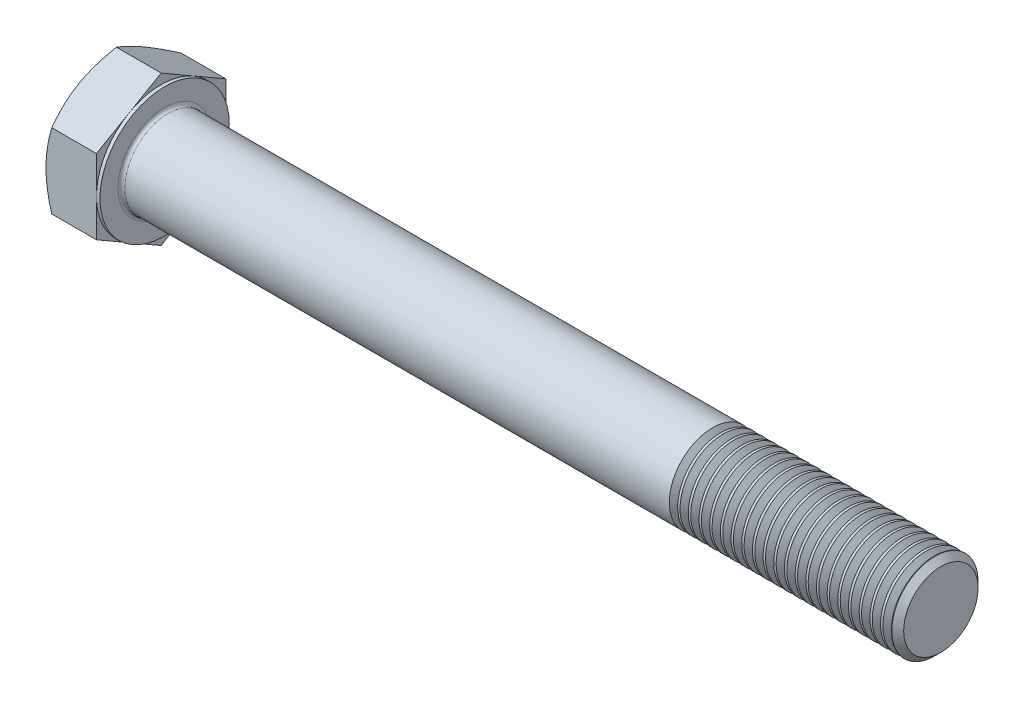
ISO-10303-21;
HEADER;
FILE_DESCRIPTION(('STEP AP214'),'2;1');
FILE_NAME('part.step','',(''),(''),'','','');
FILE_SCHEMA(('AUTOMOTIVE_DESIGN { 1 0 10303 214 1 1 1 1 }'));
ENDSEC;
DATA;
#1=APPLICATION_CONTEXT('core data for automotive mechanical design processes');
#2=APPLICATION_PROTOCOL_DEFINITION('international standard','automotive_design',2000,#1);
#3=PRODUCT_CONTEXT('',#1,'mechanical');
#4=PRODUCT('Part','Part','',(#3));
#5=PRODUCT_RELATED_PRODUCT_CATEGORY('part','',(#4));
#6=PRODUCT_DEFINITION_FORMATION('','',#4);
#7=PRODUCT_DEFINITION_CONTEXT('part definition',#1,'design');
#8=PRODUCT_DEFINITION('design','',#6,#7);
#9=PRODUCT_DEFINITION_SHAPE('','',#8);
#10=(LENGTH_UNIT() NAMED_UNIT(*) SI_UNIT(.MILLI.,.METRE.));
#11=(NAMED_UNIT(*) PLANE_ANGLE_UNIT() SI_UNIT($,.RADIAN.));
#12=(NAMED_UNIT(*) SI_UNIT($,.STERADIAN.) SOLID_ANGLE_UNIT());
#13=UNCERTAINTY_MEASURE_WITH_UNIT(LENGTH_MEASURE(1.E-05),#10,'distance_accuracy_value','');
#14=(GEOMETRIC_REPRESENTATION_CONTEXT(3) GLOBAL_UNCERTAINTY_ASSIGNED_CONTEXT((#13)) GLOBAL_UNIT_ASSIGNED_CONTEXT((#10,
#11,#12)) REPRESENTATION_CONTEXT('',''));
#15=CARTESIAN_POINT('',(0.,0.,0.));
#16=DIRECTION('',(0.,0.,1.));
#17=DIRECTION('',(1.,0.,0.));
#18=AXIS2_PLACEMENT_3D('',#15,#16,#17);
#19=CARTESIAN_POINT('',(12.5,17.3205080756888,0.));
#20=DIRECTION('',(1.,0.,0.));
#21=DIRECTION('',(0.,0.,-1.));
#22=AXIS2_PLACEMENT_3D('',#19,#20,#21);
#23=PLANE('',#22);
#24=CARTESIAN_POINT('',(12.5,0.,0.));
#25=DIRECTION('',(1.,0.,0.));
#26=DIRECTION('',(0.,0.,-1.));
#27=AXIS2_PLACEMENT_3D('',#24,#25,#26);
#28=CIRCLE('',#27,10.8);
#29=CARTESIAN_POINT('',(12.5,0.,-10.8));
#30=VERTEX_POINT('',#29);
#31=EDGE_CURVE('E35',#30,#30,#28,.F.);
#32=ORIENTED_EDGE('',*,*,#31,.T.);
#33=EDGE_LOOP('',(#32));
#34=FACE_BOUND('',#33,.T.);
#35=CARTESIAN_POINT('',(12.5,0.,0.));
#36=DIRECTION('',(1.,0.,0.));
#37=DIRECTION('',(0.,0.,-1.));
#38=AXIS2_PLACEMENT_3D('',#35,#36,#37);
#39=CIRCLE('',#38,15.);
#40=CARTESIAN_POINT('',(12.5,0.,-15.));
#41=VERTEX_POINT('',#40);
#42=EDGE_CURVE('E252',#41,#41,#39,.T.);
#43=ORIENTED_EDGE('',*,*,#42,.T.);
#44=EDGE_LOOP('',(#43));
#45=FACE_BOUND('',#44,.T.);
#46=ADVANCED_FACE('F26',(#34,#45),#23,.T.);
#47=CARTESIAN_POINT('',(0.,0.,0.));
#48=DIRECTION('',(-1.,0.,0.));
#49=DIRECTION('',(0.,0.,1.));
#50=AXIS2_PLACEMENT_3D('',#47,#48,#49);
#51=CYLINDRICAL_SURFACE('',#50,10.);
#52=CARTESIAN_POINT('',(139.5379148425,0.,0.));
#53=DIRECTION('',(-1.,0.,0.));
#54=DIRECTION('',(0.,-1.,0.));
#55=AXIS2_PLACEMENT_3D('',#52,#53,#54);
#56=CIRCLE('',#55,10.);
#57=CARTESIAN_POINT('',(139.5379148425,-10.,0.));
#58=VERTEX_POINT('',#57);
#59=EDGE_CURVE('E339',#58,#58,#56,.T.);
#60=ORIENTED_EDGE('',*,*,#59,.T.);
#61=EDGE_LOOP('',(#60));
#62=FACE_BOUND('',#61,.T.);
#63=CARTESIAN_POINT('',(13.3,0.,0.));
#64=DIRECTION('',(1.,0.,0.));
#65=DIRECTION('',(0.,0.,-1.));
#66=AXIS2_PLACEMENT_3D('',#63,#64,#65);
#67=CIRCLE('',#66,10.);
#68=CARTESIAN_POINT('',(13.3,0.,-10.));
#69=VERTEX_POINT('',#68);
#70=EDGE_CURVE('E11',#69,#69,#67,.T.);
#71=ORIENTED_EDGE('',*,*,#70,.T.);
#72=EDGE_LOOP('',(#71));
#73=FACE_BOUND('',#72,.T.);
#74=ADVANCED_FACE('F236',(#62,#73),#51,.T.);
#75=CARTESIAN_POINT('',(11.7,15.,0.));
#76=DIRECTION('',(1.,0.,0.));
#77=DIRECTION('',(0.,0.,-1.));
#78=AXIS2_PLACEMENT_3D('',#75,#76,#77);
#79=PLANE('',#78);
#80=DIRECTION('',(0.,0.500000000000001,0.866025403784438));
#81=VECTOR('',#80,1.);
#82=CARTESIAN_POINT('',(11.7,8.66025403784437,-15.));
#83=LINE('',#82,#81);
#84=CARTESIAN_POINT('',(11.7,8.66025403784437,-15.));
#85=VERTEX_POINT('',#84);
#86=CARTESIAN_POINT('',(11.7,12.9903810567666,-7.50000000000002));
#87=VERTEX_POINT('',#86);
#88=EDGE_CURVE('E160',#85,#87,#83,.T.);
#89=ORIENTED_EDGE('',*,*,#88,.T.);
#90=CARTESIAN_POINT('',(11.7,0.,0.));
#91=DIRECTION('',(-1.,0.,0.));
#92=DIRECTION('',(0.,0.,1.));
#93=AXIS2_PLACEMENT_3D('',#90,#91,#92);
#94=CIRCLE('',#93,15.);
#95=CARTESIAN_POINT('',(11.7,0.,-15.));
#96=VERTEX_POINT('',#95);
#97=EDGE_CURVE('E42',#87,#96,#94,.T.);
#98=ORIENTED_EDGE('',*,*,#97,.T.);
#99=DIRECTION('',(0.,1.,0.));
#100=VECTOR('',#99,1.);
#101=CARTESIAN_POINT('',(11.7,8.66025403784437,-15.));
#102=LINE('',#101,#100);
#103=EDGE_CURVE('E253',#96,#85,#102,.T.);
#104=ORIENTED_EDGE('',*,*,#103,.T.);
#105=EDGE_LOOP('',(#89,#98,#104));
#106=FACE_BOUND('',#105,.T.);
#107=ADVANCED_FACE('F242',(#106),#79,.T.);
#108=CARTESIAN_POINT('',(11.7,17.3205080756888,0.));
#109=VERTEX_POINT('',#108);
#110=EDGE_CURVE('E158',#87,#109,#83,.T.);
#111=ORIENTED_EDGE('',*,*,#110,.T.);
#112=DIRECTION('',(0.,-0.500000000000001,0.866025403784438));
#113=VECTOR('',#112,1.);
#114=CARTESIAN_POINT('',(11.7,17.3205080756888,0.));
#115=LINE('',#114,#113);
#116=CARTESIAN_POINT('',(11.7,12.9903810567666,7.50000000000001));
#117=VERTEX_POINT('',#116);
#118=EDGE_CURVE('E157',#109,#117,#115,.T.);
#119=ORIENTED_EDGE('',*,*,#118,.T.);
#120=EDGE_CURVE('E146',#117,#87,#94,.T.);
#121=ORIENTED_EDGE('',*,*,#120,.T.);
#122=EDGE_LOOP('',(#111,#119,#121));
#123=FACE_BOUND('',#122,.T.);
#124=ADVANCED_FACE('F281',(#123),#79,.T.);
#125=CARTESIAN_POINT('',(11.7,8.66025403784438,15.));
#126=VERTEX_POINT('',#125);
#127=EDGE_CURVE('E124',#117,#126,#115,.T.);
#128=ORIENTED_EDGE('',*,*,#127,.T.);
#129=DIRECTION('',(0.,-1.,0.));
#130=VECTOR('',#129,1.);
#131=CARTESIAN_POINT('',(11.7,8.66025403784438,15.));
#132=LINE('',#131,#130);
#133=CARTESIAN_POINT('',(11.7,0.,15.));
#134=VERTEX_POINT('',#133);
#135=EDGE_CURVE('E118',#126,#134,#132,.T.);
#136=ORIENTED_EDGE('',*,*,#135,.T.);
#137=EDGE_CURVE('E122',#134,#117,#94,.T.);
#138=ORIENTED_EDGE('',*,*,#137,.T.);
#139=EDGE_LOOP('',(#128,#136,#138));
#140=FACE_BOUND('',#139,.T.);
#141=ADVANCED_FACE('F120',(#140),#79,.T.);
#142=CARTESIAN_POINT('',(11.7,-8.66025403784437,15.));
#143=VERTEX_POINT('',#142);
#144=EDGE_CURVE('E128',#134,#143,#132,.T.);
#145=ORIENTED_EDGE('',*,*,#144,.T.);
#146=DIRECTION('',(0.,-0.500000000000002,-0.866025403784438));
#147=VECTOR('',#146,1.);
#148=CARTESIAN_POINT('',(11.7,-17.3205080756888,0.));
#149=LINE('',#148,#147);
#150=CARTESIAN_POINT('',(11.7,-12.9903810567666,7.50000000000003));
#151=VERTEX_POINT('',#150);
#152=EDGE_CURVE('E135',#143,#151,#149,.T.);
#153=ORIENTED_EDGE('',*,*,#152,.T.);
#154=EDGE_CURVE('E132',#151,#134,#94,.T.);
#155=ORIENTED_EDGE('',*,*,#154,.T.);
#156=EDGE_LOOP('',(#145,#153,#155));
#157=FACE_BOUND('',#156,.T.);
#158=ADVANCED_FACE('F133',(#157),#79,.T.);
#159=CARTESIAN_POINT('',(11.7,-17.3205080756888,0.));
#160=VERTEX_POINT('',#159);
#161=EDGE_CURVE('E152',#151,#160,#149,.T.);
#162=ORIENTED_EDGE('',*,*,#161,.T.);
#163=DIRECTION('',(0.,0.500000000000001,-0.866025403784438));
#164=VECTOR('',#163,1.);
#165=CARTESIAN_POINT('',(11.7,-8.66025403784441,-15.));
#166=LINE('',#165,#164);
#167=CARTESIAN_POINT('',(11.7,-12.9903810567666,-7.50000000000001));
#168=VERTEX_POINT('',#167);
#169=EDGE_CURVE('E335',#160,#168,#166,.T.);
#170=ORIENTED_EDGE('',*,*,#169,.T.);
#171=EDGE_CURVE('E139',#168,#151,#94,.T.);
#172=ORIENTED_EDGE('',*,*,#171,.T.);
#173=EDGE_LOOP('',(#162,#170,#172));
#174=FACE_BOUND('',#173,.T.);
#175=ADVANCED_FACE('F558',(#174),#79,.T.);
#176=CARTESIAN_POINT('',(11.7,-8.6602540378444,-15.));
#177=VERTEX_POINT('',#176);
#178=EDGE_CURVE('E147',#168,#177,#166,.T.);
#179=ORIENTED_EDGE('',*,*,#178,.T.);
#180=EDGE_CURVE('E256',#177,#96,#102,.T.);
#181=ORIENTED_EDGE('',*,*,#180,.T.);
#182=EDGE_CURVE('E268',#96,#168,#94,.T.);
#183=ORIENTED_EDGE('',*,*,#182,.T.);
#184=EDGE_LOOP('',(#179,#181,#183));
#185=FACE_BOUND('',#184,.T.);
#186=ADVANCED_FACE('F267',(#185),#79,.T.);
#187=CARTESIAN_POINT('',(0.,0.,0.));
#188=DIRECTION('',(-1.,0.,0.));
#189=DIRECTION('',(0.,0.,1.));
#190=AXIS2_PLACEMENT_3D('',#187,#188,#189);
#191=CYLINDRICAL_SURFACE('',#190,15.);
#192=ORIENTED_EDGE('',*,*,#97,.F.);
#193=ORIENTED_EDGE('',*,*,#120,.F.);
#194=ORIENTED_EDGE('',*,*,#137,.F.);
#195=ORIENTED_EDGE('',*,*,#154,.F.);
#196=ORIENTED_EDGE('',*,*,#171,.F.);
#197=ORIENTED_EDGE('',*,*,#182,.F.);
#198=EDGE_LOOP('',(#192,#193,#194,#195,#196,#197));
#199=FACE_BOUND('',#198,.T.);
#200=ORIENTED_EDGE('',*,*,#42,.F.);
#201=EDGE_LOOP('',(#200));
#202=FACE_BOUND('',#201,.T.);
#203=ADVANCED_FACE('F143',(#199,#202),#191,.T.);
#204=CARTESIAN_POINT('',(0.,17.3205080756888,0.));
#205=DIRECTION('',(1.,0.,0.));
#206=DIRECTION('',(0.,0.,-1.));
#207=AXIS2_PLACEMENT_3D('',#204,#205,#206);
#208=PLANE('',#207);
#209=CARTESIAN_POINT('',(0.,0.,0.));
#210=DIRECTION('',(1.,0.,0.));
#211=DIRECTION('',(0.,0.,-1.));
#212=AXIS2_PLACEMENT_3D('',#209,#210,#211);
#213=CIRCLE('',#212,15.);
#214=CARTESIAN_POINT('',(0.,0.,-15.));
#215=VERTEX_POINT('',#214);
#216=CARTESIAN_POINT('',(0.,12.9903810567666,-7.50000000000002));
#217=VERTEX_POINT('',#216);
#218=EDGE_CURVE('E254',#215,#217,#213,.T.);
#219=ORIENTED_EDGE('',*,*,#218,.F.);
#220=CARTESIAN_POINT('',(0.,-12.9903810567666,-7.50000000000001));
#221=VERTEX_POINT('',#220);
#222=EDGE_CURVE('E260',#221,#215,#213,.T.);
#223=ORIENTED_EDGE('',*,*,#222,.F.);
#224=CARTESIAN_POINT('',(0.,-12.9903810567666,7.50000000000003));
#225=VERTEX_POINT('',#224);
#226=EDGE_CURVE('E317',#225,#221,#213,.T.);
#227=ORIENTED_EDGE('',*,*,#226,.F.);
#228=CARTESIAN_POINT('',(0.,0.,15.));
#229=VERTEX_POINT('',#228);
#230=EDGE_CURVE('E313',#229,#225,#213,.T.);
#231=ORIENTED_EDGE('',*,*,#230,.F.);
#232=CARTESIAN_POINT('',(0.,0.,0.));
#233=DIRECTION('',(-1.,0.,0.));
#234=DIRECTION('',(0.,0.,1.));
#235=AXIS2_PLACEMENT_3D('',#232,#233,#234);
#236=CIRCLE('',#235,15.);
#237=CARTESIAN_POINT('',(0.,12.9903810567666,7.50000000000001));
#238=VERTEX_POINT('',#237);
#239=EDGE_CURVE('E161',#229,#238,#236,.T.);
#240=ORIENTED_EDGE('',*,*,#239,.T.);
#241=EDGE_CURVE('E258',#217,#238,#213,.T.);
#242=ORIENTED_EDGE('',*,*,#241,.F.);
#243=EDGE_LOOP('',(#219,#223,#227,#231,#240,#242));
#244=FACE_BOUND('',#243,.T.);
#245=ADVANCED_FACE('F314',(#244),#208,.F.);
#246=CARTESIAN_POINT('',(0.,0.,0.));
#247=DIRECTION('',(1.,0.,0.));
#248=DIRECTION('',(0.,0.,-1.));
#249=AXIS2_PLACEMENT_3D('',#246,#247,#248);
#250=CONICAL_SURFACE('',#249,15.,1.0471975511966);
#251=CARTESIAN_POINT('',(1.33981262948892,8.66013856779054,15.0002));
#252=CARTESIAN_POINT('',(1.22992178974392,8.85048754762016,14.6705058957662));
#253=CARTESIAN_POINT('',(1.1250175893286,9.04157899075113,14.3395258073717));
#254=CARTESIAN_POINT('',(0.926568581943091,9.42529420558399,13.674911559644));
#255=CARTESIAN_POINT('',(0.833027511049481,9.61791845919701,13.3412765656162));
#256=CARTESIAN_POINT('',(0.658562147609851,10.0050715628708,12.6707077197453));
#257=CARTESIAN_POINT('',(0.577667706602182,10.199603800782,12.333767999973));
#258=CARTESIAN_POINT('',(0.430232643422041,10.5900200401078,11.6575472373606));
#259=CARTESIAN_POINT('',(0.363691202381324,10.7859039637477,11.3182663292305));
#260=CARTESIAN_POINT('',(0.247792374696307,11.1740042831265,10.6460568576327));
#261=CARTESIAN_POINT('',(0.198051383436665,11.3661918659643,10.3131781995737));
#262=CARTESIAN_POINT('',(0.114646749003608,11.7514476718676,9.64589556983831));
#263=CARTESIAN_POINT('',(0.0809834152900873,11.9445159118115,9.31149156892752));
#264=CARTESIAN_POINT('',(0.0305840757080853,12.3309767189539,8.64212181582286));
#265=CARTESIAN_POINT('',(0.0138279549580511,12.5243686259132,8.30715720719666));
#266=CARTESIAN_POINT('',(-0.0023966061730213,12.9113309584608,7.63691878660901));
#267=CARTESIAN_POINT('',(-0.00186558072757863,13.1049013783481,7.30164498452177));
#268=CARTESIAN_POINT('',(0.0152766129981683,13.4667798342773,6.67485311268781));
#269=CARTESIAN_POINT('',(0.0297968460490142,13.6351136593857,6.38329037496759));
#270=CARTESIAN_POINT('',(0.071637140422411,13.9713941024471,5.80083556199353));
#271=CARTESIAN_POINT('',(0.0989581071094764,14.1393406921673,5.50994353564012));
#272=CARTESIAN_POINT('',(0.165923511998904,14.4747554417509,4.92898814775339));
#273=CARTESIAN_POINT('',(0.205578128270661,14.6422230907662,4.63892567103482));
#274=CARTESIAN_POINT('',(0.296515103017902,14.9763732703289,4.06016058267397));
#275=CARTESIAN_POINT('',(0.347798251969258,15.1430557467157,3.77145806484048));
#276=CARTESIAN_POINT('',(0.520386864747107,15.6490296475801,2.8950855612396));
#277=CARTESIAN_POINT('',(0.658901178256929,15.9868558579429,2.30995340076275));
#278=CARTESIAN_POINT('',(0.973271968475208,16.6574708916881,1.14841408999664));
#279=CARTESIAN_POINT('',(1.14905461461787,16.9902683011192,0.571992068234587));
#280=CARTESIAN_POINT('',(1.33981262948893,17.3206235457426,-0.000200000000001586));
#281=B_SPLINE_CURVE_WITH_KNOTS('',3,(#251,#252,#253,#254,#255,#256,#257,#258,#259,#260,#261,
#262,#263,#264,#265,#266,#267,#268,#269,#270,#271,#272,#273,#274,#275,#276,#277,#278,#279,#280),
.UNSPECIFIED.,.F.,.F.,(4,2,2,2,2,2,2,2,2,2,2,2,2,2,4),(0.,1.18875411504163,2.37789802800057,
3.56980778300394,4.76164951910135,5.92407379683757,7.0865204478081,8.24758247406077,
9.40860862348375,10.4193068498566,11.4300765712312,12.4416826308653,13.4533574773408,
15.5211962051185,17.5849760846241),.UNSPECIFIED.);
#282=CARTESIAN_POINT('',(1.3397459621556,17.3205080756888,0.));
#283=VERTEX_POINT('',#282);
#284=EDGE_CURVE('E207',#238,#283,#281,.T.);
#285=ORIENTED_EDGE('',*,*,#284,.T.);
#286=CARTESIAN_POINT('',(1.33981262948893,17.3206235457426,0.000199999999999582));
#287=CARTESIAN_POINT('',(1.22992178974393,17.130274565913,-0.3294941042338));
#288=CARTESIAN_POINT('',(1.12501758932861,16.939183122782,-0.6604741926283));
#289=CARTESIAN_POINT('',(0.9265685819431,16.5554679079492,-1.32508844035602));
#290=CARTESIAN_POINT('',(0.83302751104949,16.3628436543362,-1.6587234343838));
#291=CARTESIAN_POINT('',(0.658562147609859,15.9756905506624,-2.32929228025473));
#292=CARTESIAN_POINT('',(0.577667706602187,15.7811583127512,-2.66623200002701));
#293=CARTESIAN_POINT('',(0.430232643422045,15.3907420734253,-3.34245276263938));
#294=CARTESIAN_POINT('',(0.363691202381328,15.1948581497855,-3.68173367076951));
#295=CARTESIAN_POINT('',(0.24779237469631,14.8067578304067,-4.35394314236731));
#296=CARTESIAN_POINT('',(0.198051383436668,14.6145702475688,-4.68682180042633));
#297=CARTESIAN_POINT('',(0.114646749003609,14.2293144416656,-5.35410443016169));
#298=CARTESIAN_POINT('',(0.0809834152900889,14.0362462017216,-5.68850843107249));
#299=CARTESIAN_POINT('',(0.0305840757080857,13.6497853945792,-6.35787818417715));
#300=CARTESIAN_POINT('',(0.0138279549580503,13.4563934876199,-6.69284279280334));
#301=CARTESIAN_POINT('',(-0.00239660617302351,13.0694311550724,-7.363081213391));
#302=CARTESIAN_POINT('',(-0.0018655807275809,12.8758607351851,-7.69835501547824));
#303=CARTESIAN_POINT('',(0.0152766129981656,12.5139822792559,-8.32514688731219));
#304=CARTESIAN_POINT('',(0.0297968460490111,12.3456484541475,-8.61670962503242));
#305=CARTESIAN_POINT('',(0.0716371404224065,12.0093680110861,-9.19916443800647));
#306=CARTESIAN_POINT('',(0.0989581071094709,11.8414214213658,-9.49005646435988));
#307=CARTESIAN_POINT('',(0.165923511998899,11.5060066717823,-10.0710118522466));
#308=CARTESIAN_POINT('',(0.205578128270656,11.338539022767,-10.3610743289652));
#309=CARTESIAN_POINT('',(0.296515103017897,11.0043888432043,-10.939839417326));
#310=CARTESIAN_POINT('',(0.34779825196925,10.8377063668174,-11.2285419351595));
#311=CARTESIAN_POINT('',(0.520386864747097,10.3317324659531,-12.1049144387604));
#312=CARTESIAN_POINT('',(0.658901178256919,9.99390625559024,-12.6900465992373));
#313=CARTESIAN_POINT('',(0.973271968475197,9.32329122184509,-13.8515859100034));
#314=CARTESIAN_POINT('',(1.14905461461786,8.99049381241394,-14.4280079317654));
#315=CARTESIAN_POINT('',(1.33981262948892,8.66013856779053,-15.0002));
#316=B_SPLINE_CURVE_WITH_KNOTS('',3,(#286,#287,#288,#289,#290,#291,#292,#293,#294,#295,#296,
#297,#298,#299,#300,#301,#302,#303,#304,#305,#306,#307,#308,#309,#310,#311,#312,#313,#314,#315),
.UNSPECIFIED.,.F.,.F.,(4,2,2,2,2,2,2,2,2,2,2,2,2,2,4),(0.,1.18875411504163,2.37789802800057,
3.56980778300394,4.76164951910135,5.92407379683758,7.08652044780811,8.24758247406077,
9.40860862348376,10.4193068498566,11.4300765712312,12.4416826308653,13.4533574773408,
15.5211962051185,17.5849760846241),.UNSPECIFIED.);
#317=EDGE_CURVE('E50',#283,#217,#316,.T.);
#318=ORIENTED_EDGE('',*,*,#317,.T.);
#319=ORIENTED_EDGE('',*,*,#241,.T.);
#320=EDGE_LOOP('',(#285,#318,#319));
#321=FACE_BOUND('',#320,.T.);
#322=ADVANCED_FACE('F311',(#321),#250,.T.);
#323=CARTESIAN_POINT('',(7.37312634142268,-23.3710902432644,15.));
#324=CARTESIAN_POINT('',(7.21375262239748,-23.0430760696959,15.));
#325=CARTESIAN_POINT('',(7.05516544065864,-22.7146799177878,15.));
#326=CARTESIAN_POINT('',(6.73974206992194,-22.0570439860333,15.));
#327=CARTESIAN_POINT('',(6.58290589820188,-21.7278041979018,15.));
#328=CARTESIAN_POINT('',(6.11525014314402,-20.7386136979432,15.));
#329=CARTESIAN_POINT('',(5.80732977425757,-20.0772872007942,15.));
#330=CARTESIAN_POINT('',(5.19942693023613,-18.7466975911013,15.));
#331=CARTESIAN_POINT('',(4.89949586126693,-18.0774109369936,15.));
#332=CARTESIAN_POINT('',(4.31175828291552,-16.7335531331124,15.));
#333=CARTESIAN_POINT('',(4.02395120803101,-16.0589822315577,15.));
#334=CARTESIAN_POINT('',(3.45448123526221,-14.6812618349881,15.));
#335=CARTESIAN_POINT('',(3.17332879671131,-13.9779002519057,15.));
#336=CARTESIAN_POINT('',(2.63203971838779,-12.5629833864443,15.));
#337=CARTESIAN_POINT('',(2.37190542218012,-11.8514272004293,15.));
#338=CARTESIAN_POINT('',(1.8794064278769,-10.4203092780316,15.));
#339=CARTESIAN_POINT('',(1.64698643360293,-9.70076672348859,15.));
#340=CARTESIAN_POINT('',(1.21728875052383,-8.25129237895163,15.));
#341=CARTESIAN_POINT('',(1.02000010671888,-7.5213639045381,15.));
#342=CARTESIAN_POINT('',(0.758044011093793,-6.42057854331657,15.));
#343=CARTESIAN_POINT('',(0.676568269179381,-6.05369801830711,15.));
#344=CARTESIAN_POINT('',(0.525901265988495,-5.31741005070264,15.));
#345=CARTESIAN_POINT('',(0.45670975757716,-4.94800265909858,15.));
#346=CARTESIAN_POINT('',(0.331825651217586,-4.20690684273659,15.));
#347=CARTESIAN_POINT('',(0.276132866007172,-3.83521844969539,15.));
#348=CARTESIAN_POINT('',(0.179353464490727,-3.08994807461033,15.));
#349=CARTESIAN_POINT('',(0.138266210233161,-2.71636617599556,15.));
#350=CARTESIAN_POINT('',(0.0720349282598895,-1.97275308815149,15.));
#351=CARTESIAN_POINT('',(0.0466876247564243,-1.60274011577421,15.));
#352=CARTESIAN_POINT('',(0.0116690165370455,-0.861974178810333,15.));
#353=CARTESIAN_POINT('',(0.00199744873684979,-0.491221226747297,15.));
#354=CARTESIAN_POINT('',(-0.00143922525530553,0.250361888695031,15.));
#355=CARTESIAN_POINT('',(0.0047957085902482,0.621192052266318,15.));
#356=CARTESIAN_POINT('',(0.033018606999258,1.36225664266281,15.));
#357=CARTESIAN_POINT('',(0.0550072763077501,1.73249104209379,15.));
#358=CARTESIAN_POINT('',(0.126051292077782,2.61901692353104,15.));
#359=CARTESIAN_POINT('',(0.182399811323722,3.13473445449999,15.));
#360=CARTESIAN_POINT('',(0.322620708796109,4.16241630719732,15.));
#361=CARTESIAN_POINT('',(0.406496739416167,4.67438012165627,15.));
#362=CARTESIAN_POINT('',(0.598789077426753,5.69404144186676,15.));
#363=CARTESIAN_POINT('',(0.707224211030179,6.20173536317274,15.));
#364=CARTESIAN_POINT('',(0.94531956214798,7.21206683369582,15.));
#365=CARTESIAN_POINT('',(1.07497948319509,7.71470445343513,15.));
#366=CARTESIAN_POINT('',(1.35544197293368,8.72603000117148,15.));
#367=CARTESIAN_POINT('',(1.50664978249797,9.2346047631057,15.));
#368=CARTESIAN_POINT('',(1.82490436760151,10.246745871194,15.));
#369=CARTESIAN_POINT('',(1.99195124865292,10.7503121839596,15.));
#370=CARTESIAN_POINT('',(2.33921280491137,11.7526813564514,15.));
#371=CARTESIAN_POINT('',(2.51942324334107,12.2514856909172,15.));
#372=CARTESIAN_POINT('',(2.89087066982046,13.2449469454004,15.));
#373=CARTESIAN_POINT('',(3.08210752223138,13.73960391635,15.));
#374=CARTESIAN_POINT('',(3.54947439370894,14.9157121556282,15.));
#375=CARTESIAN_POINT('',(3.82985054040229,15.5954736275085,15.));
#376=CARTESIAN_POINT('',(4.40448813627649,16.9491200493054,15.));
#377=CARTESIAN_POINT('',(4.69875048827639,17.6230046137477,15.));
#378=CARTESIAN_POINT('',(5.29835231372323,18.9660045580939,15.));
#379=CARTESIAN_POINT('',(5.60369438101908,19.6351187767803,15.));
#380=CARTESIAN_POINT('',(6.22319663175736,20.9692236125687,15.));
#381=CARTESIAN_POINT('',(6.53735661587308,21.6342143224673,15.));
#382=CARTESIAN_POINT('',(7.17319119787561,22.9615174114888,15.));
#383=CARTESIAN_POINT('',(7.49487393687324,23.6238258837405,15.));
#384=CARTESIAN_POINT('',(8.14411318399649,24.9455571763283,15.));
#385=CARTESIAN_POINT('',(8.47166971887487,25.6049799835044,15.));
#386=CARTESIAN_POINT('',(9.13159579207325,26.9212980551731,15.));
#387=CARTESIAN_POINT('',(9.46396466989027,27.5781936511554,15.));
#388=CARTESIAN_POINT('',(10.1327647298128,28.8899147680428,15.));
#389=CARTESIAN_POINT('',(10.4691959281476,29.5447402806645,15.));
#390=CARTESIAN_POINT('',(11.4259204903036,31.3950227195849,15.));
#391=CARTESIAN_POINT('',(12.0502117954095,32.5884123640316,15.));
#392=CARTESIAN_POINT('',(13.3073006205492,34.9707491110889,15.));
#393=CARTESIAN_POINT('',(13.9400984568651,36.1596960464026,15.));
#394=CARTESIAN_POINT('',(15.2105565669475,38.5310463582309,15.));
#395=CARTESIAN_POINT('',(15.8482001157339,39.7134587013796,15.));
#396=CARTESIAN_POINT('',(16.8084387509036,41.484986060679,15.));
#397=CARTESIAN_POINT('',(17.1291381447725,42.0751301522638,15.));
#398=CARTESIAN_POINT('',(17.7716684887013,43.2548008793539,15.));
#399=CARTESIAN_POINT('',(18.0934994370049,43.8443275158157,15.));
#400=CARTESIAN_POINT('',(18.4158306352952,44.4335805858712,15.));
#401=B_SPLINE_CURVE_WITH_KNOTS('',3,(#323,#324,#325,#326,#327,#328,#329,#330,#331,#332,#333,
#334,#335,#336,#337,#338,#339,#340,#341,#342,#343,#344,#345,#346,#347,#348,#349,#350,#351,#352,
#353,#354,#355,#356,#357,#358,#359,#360,#361,#362,#363,#364,#365,#366,#367,#368,#369,#370,#371,
#372,#373,#374,#375,#376,#377,#378,#379,#380,#381,#382,#383,#384,#385,#386,#387,#388,#389,#390,
#391,#392,#393,#394,#395,#396,#397,#398,#399,#400),.UNSPECIFIED.,.F.,.F.,(4,2,2,2,2,2,2,2,2,2,2,
2,2,2,2,2,2,2,2,2,2,2,2,2,2,2,2,2,2,2,2,2,2,2,2,2,2,2,4),(0.,1.09404536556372,2.1881015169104,
4.37653199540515,6.57669491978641,8.77675510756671,11.0489153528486,13.3213285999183,
15.5891291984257,17.8562213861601,18.9835047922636,20.1107655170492,21.2380106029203,
22.3652064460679,23.4775244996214,24.5898238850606,25.7021260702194,26.8144780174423,
28.369980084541,29.9256886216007,31.4825937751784,33.0394771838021,34.6309007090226,
36.2223348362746,37.8132589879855,39.4041635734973,41.6098943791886,43.8157687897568,
46.0221629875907,48.2285073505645,50.4373613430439,52.6462253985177,54.854789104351,
57.0633616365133,61.1037632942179,65.1443155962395,69.1744593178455,71.1894182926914,
73.2043741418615),.UNSPECIFIED.);
#402=CARTESIAN_POINT('',(1.33974596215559,8.66025403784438,15.));
#403=VERTEX_POINT('',#402);
#404=EDGE_CURVE('E219',#229,#403,#401,.T.);
#405=ORIENTED_EDGE('',*,*,#404,.T.);
#406=EDGE_CURVE('E218',#403,#238,#281,.T.);
#407=ORIENTED_EDGE('',*,*,#406,.T.);
#408=ORIENTED_EDGE('',*,*,#239,.F.);
#409=EDGE_LOOP('',(#405,#407,#408));
#410=FACE_BOUND('',#409,.T.);
#411=ADVANCED_FACE('F308',(#410),#250,.T.);
#412=CARTESIAN_POINT('',(1.33974596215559,-8.66025403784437,15.));
#413=VERTEX_POINT('',#412);
#414=EDGE_CURVE('E299',#413,#229,#401,.T.);
#415=ORIENTED_EDGE('',*,*,#414,.T.);
#416=ORIENTED_EDGE('',*,*,#230,.T.);
#417=CARTESIAN_POINT('',(1.33981262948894,-17.3206235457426,-0.000200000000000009));
#418=CARTESIAN_POINT('',(1.22992178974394,-17.130274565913,0.329494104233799));
#419=CARTESIAN_POINT('',(1.12501758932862,-16.9391831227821,0.660474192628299));
#420=CARTESIAN_POINT('',(0.92656858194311,-16.5554679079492,1.32508844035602));
#421=CARTESIAN_POINT('',(0.833027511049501,-16.3628436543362,1.6587234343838));
#422=CARTESIAN_POINT('',(0.658562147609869,-15.9756905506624,2.32929228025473));
#423=CARTESIAN_POINT('',(0.577667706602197,-15.7811583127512,2.66623200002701));
#424=CARTESIAN_POINT('',(0.430232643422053,-15.3907420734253,3.34245276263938));
#425=CARTESIAN_POINT('',(0.363691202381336,-15.1948581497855,3.68173367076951));
#426=CARTESIAN_POINT('',(0.247792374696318,-14.8067578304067,4.35394314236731));
#427=CARTESIAN_POINT('',(0.198051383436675,-14.6145702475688,4.68682180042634));
#428=CARTESIAN_POINT('',(0.114646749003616,-14.2293144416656,5.35410443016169));
#429=CARTESIAN_POINT('',(0.0809834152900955,-14.0362462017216,5.68850843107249));
#430=CARTESIAN_POINT('',(0.0305840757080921,-13.6497853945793,6.35787818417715));
#431=CARTESIAN_POINT('',(0.0138279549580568,-13.4563934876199,6.69284279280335));
#432=CARTESIAN_POINT('',(-0.00239660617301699,-13.0694311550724,7.363081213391));
#433=CARTESIAN_POINT('',(-0.00186558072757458,-12.8758607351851,7.69835501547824));
#434=CARTESIAN_POINT('',(0.0152766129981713,-12.5139822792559,8.3251468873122));
#435=CARTESIAN_POINT('',(0.0297968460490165,-12.3456484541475,8.61670962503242));
#436=CARTESIAN_POINT('',(0.0716371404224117,-12.0093680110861,9.19916443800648));
#437=CARTESIAN_POINT('',(0.0989581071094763,-11.8414214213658,9.49005646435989));
#438=CARTESIAN_POINT('',(0.165923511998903,-11.5060066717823,10.0710118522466));
#439=CARTESIAN_POINT('',(0.20557812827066,-11.338539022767,10.3610743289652));
#440=CARTESIAN_POINT('',(0.2965151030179,-11.0043888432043,10.939839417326));
#441=CARTESIAN_POINT('',(0.347798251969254,-10.8377063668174,11.2285419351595));
#442=CARTESIAN_POINT('',(0.520386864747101,-10.3317324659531,12.1049144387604));
#443=CARTESIAN_POINT('',(0.658901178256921,-9.99390625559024,12.6900465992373));
#444=CARTESIAN_POINT('',(0.973271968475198,-9.32329122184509,13.8515859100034));
#445=CARTESIAN_POINT('',(1.14905461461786,-8.99049381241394,14.4280079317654));
#446=CARTESIAN_POINT('',(1.33981262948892,-8.66013856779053,15.0002));
#447=B_SPLINE_CURVE_WITH_KNOTS('',3,(#417,#418,#419,#420,#421,#422,#423,#424,#425,#426,#427,
#428,#429,#430,#431,#432,#433,#434,#435,#436,#437,#438,#439,#440,#441,#442,#443,#444,#445,#446),
.UNSPECIFIED.,.F.,.F.,(4,2,2,2,2,2,2,2,2,2,2,2,2,2,4),(0.,1.18875411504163,2.37789802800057,
3.56980778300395,4.76164951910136,5.92407379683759,7.08652044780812,8.24758247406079,
9.40860862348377,10.4193068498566,11.4300765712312,12.4416826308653,13.4533574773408,
15.5211962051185,17.5849760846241),.UNSPECIFIED.);
#448=EDGE_CURVE('E209',#225,#413,#447,.T.);
#449=ORIENTED_EDGE('',*,*,#448,.T.);
#450=EDGE_LOOP('',(#415,#416,#449));
#451=FACE_BOUND('',#450,.T.);
#452=ADVANCED_FACE('F179',(#451),#250,.T.);
#453=CARTESIAN_POINT('',(1.33974596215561,-17.3205080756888,0.));
#454=VERTEX_POINT('',#453);
#455=EDGE_CURVE('E202',#454,#225,#447,.T.);
#456=ORIENTED_EDGE('',*,*,#455,.T.);
#457=ORIENTED_EDGE('',*,*,#226,.T.);
#458=CARTESIAN_POINT('',(1.33981262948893,-8.66013856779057,-15.0002));
#459=CARTESIAN_POINT('',(1.22992178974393,-8.85048754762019,-14.6705058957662));
#460=CARTESIAN_POINT('',(1.1250175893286,-9.04157899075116,-14.3395258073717));
#461=CARTESIAN_POINT('',(0.9265685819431,-9.42529420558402,-13.674911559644));
#462=CARTESIAN_POINT('',(0.833027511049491,-9.61791845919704,-13.3412765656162));
#463=CARTESIAN_POINT('',(0.658562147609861,-10.0050715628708,-12.6707077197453));
#464=CARTESIAN_POINT('',(0.57766770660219,-10.199603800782,-12.333767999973));
#465=CARTESIAN_POINT('',(0.430232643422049,-10.5900200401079,-11.6575472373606));
#466=CARTESIAN_POINT('',(0.363691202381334,-10.7859039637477,-11.3182663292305));
#467=CARTESIAN_POINT('',(0.247792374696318,-11.1740042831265,-10.6460568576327));
#468=CARTESIAN_POINT('',(0.198051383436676,-11.3661918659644,-10.3131781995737));
#469=CARTESIAN_POINT('',(0.114646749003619,-11.7514476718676,-9.64589556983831));
#470=CARTESIAN_POINT('',(0.0809834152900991,-11.9445159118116,-9.31149156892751));
#471=CARTESIAN_POINT('',(0.0305840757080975,-12.3309767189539,-8.64212181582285));
#472=CARTESIAN_POINT('',(0.013827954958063,-12.5243686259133,-8.30715720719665));
#473=CARTESIAN_POINT('',(-0.00239660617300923,-12.9113309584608,-7.636918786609));
#474=CARTESIAN_POINT('',(-0.00186558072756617,-13.1049013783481,-7.30164498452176));
#475=CARTESIAN_POINT('',(0.0152766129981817,-13.4667798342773,-6.6748531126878));
#476=CARTESIAN_POINT('',(0.0297968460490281,-13.6351136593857,-6.38329037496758));
#477=CARTESIAN_POINT('',(0.0716371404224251,-13.9713941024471,-5.80083556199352));
#478=CARTESIAN_POINT('',(0.0989581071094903,-14.1393406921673,-5.50994353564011));
#479=CARTESIAN_POINT('',(0.165923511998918,-14.4747554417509,-4.92898814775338));
#480=CARTESIAN_POINT('',(0.205578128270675,-14.6422230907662,-4.63892567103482));
#481=CARTESIAN_POINT('',(0.296515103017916,-14.9763732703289,-4.06016058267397));
#482=CARTESIAN_POINT('',(0.34779825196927,-15.1430557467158,-3.77145806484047));
#483=CARTESIAN_POINT('',(0.520386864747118,-15.6490296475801,-2.89508556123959));
#484=CARTESIAN_POINT('',(0.658901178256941,-15.9868558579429,-2.30995340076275));
#485=CARTESIAN_POINT('',(0.973271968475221,-16.6574708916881,-1.14841408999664));
#486=CARTESIAN_POINT('',(1.14905461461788,-16.9902683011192,-0.57199206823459));
#487=CARTESIAN_POINT('',(1.33981262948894,-17.3206235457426,0.000199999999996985));
#488=B_SPLINE_CURVE_WITH_KNOTS('',3,(#458,#459,#460,#461,#462,#463,#464,#465,#466,#467,#468,
#469,#470,#471,#472,#473,#474,#475,#476,#477,#478,#479,#480,#481,#482,#483,#484,#485,#486,#487),
.UNSPECIFIED.,.F.,.F.,(4,2,2,2,2,2,2,2,2,2,2,2,2,2,4),(0.,1.18875411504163,2.37789802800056,
3.56980778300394,4.76164951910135,5.92407379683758,7.08652044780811,8.24758247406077,
9.40860862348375,10.4193068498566,11.4300765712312,12.4416826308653,13.4533574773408,
15.5211962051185,17.5849760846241),.UNSPECIFIED.);
#489=EDGE_CURVE('E208',#221,#454,#488,.T.);
#490=ORIENTED_EDGE('',*,*,#489,.T.);
#491=EDGE_LOOP('',(#456,#457,#490));
#492=FACE_BOUND('',#491,.T.);
#493=ADVANCED_FACE('F331',(#492),#250,.T.);
#494=CARTESIAN_POINT('',(1.33974596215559,8.66025403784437,-15.));
#495=VERTEX_POINT('',#494);
#496=EDGE_CURVE('E210',#217,#495,#316,.T.);
#497=ORIENTED_EDGE('',*,*,#496,.T.);
#498=CARTESIAN_POINT('',(7.37312634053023,-23.3710902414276,-15.));
#499=CARTESIAN_POINT('',(7.21375262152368,-23.04307606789,-15.));
#500=CARTESIAN_POINT('',(7.05516543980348,-22.7146799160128,-15.));
#501=CARTESIAN_POINT('',(6.73974206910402,-22.0570439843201,-15.));
#502=CARTESIAN_POINT('',(6.58290589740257,-21.7278041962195,-15.));
#503=CARTESIAN_POINT('',(6.11525014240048,-20.7386136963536,-15.));
#504=CARTESIAN_POINT('',(5.80732977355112,-20.0772871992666,-15.));
#505=CARTESIAN_POINT('',(5.19942692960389,-18.7466975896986,-15.));
#506=CARTESIAN_POINT('',(4.8994958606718,-18.0774109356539,-15.));
#507=CARTESIAN_POINT('',(4.31175828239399,-16.7335531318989,-15.));
#508=CARTESIAN_POINT('',(4.02395120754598,-16.0589822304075,-15.));
#509=CARTESIAN_POINT('',(3.45448123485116,-14.6812618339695,-15.));
#510=CARTESIAN_POINT('',(3.17332879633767,-13.9779002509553,-15.));
#511=CARTESIAN_POINT('',(2.63203971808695,-12.5629833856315,-15.));
#512=CARTESIAN_POINT('',(2.37190542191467,-11.8514271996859,-15.));
#513=CARTESIAN_POINT('',(1.87940642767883,-10.4203092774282,-15.));
#514=CARTESIAN_POINT('',(1.64698643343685,-9.70076672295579,-15.));
#515=CARTESIAN_POINT('',(1.21728875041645,-8.25129237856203,-15.));
#516=CARTESIAN_POINT('',(1.02000010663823,-7.52136390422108,-15.));
#517=CARTESIAN_POINT('',(0.758044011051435,-6.42057854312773,-15.));
#518=CARTESIAN_POINT('',(0.676568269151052,-6.05369801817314,-15.));
#519=CARTESIAN_POINT('',(0.52590126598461,-5.3174100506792,-15.));
#520=CARTESIAN_POINT('',(0.45670975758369,-4.9480026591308,-15.));
#521=CARTESIAN_POINT('',(0.331825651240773,-4.20690684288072,-15.));
#522=CARTESIAN_POINT('',(0.276132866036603,-3.83521844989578,-15.));
#523=CARTESIAN_POINT('',(0.179353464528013,-3.08994807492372,-15.));
#524=CARTESIAN_POINT('',(0.138266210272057,-2.71636617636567,-15.));
#525=CARTESIAN_POINT('',(0.0720349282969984,-1.97275308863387,-15.));
#526=CARTESIAN_POINT('',(0.046687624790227,-1.60274011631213,-15.));
#527=CARTESIAN_POINT('',(0.0116690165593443,-0.861974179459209,-15.));
#528=CARTESIAN_POINT('',(0.00199744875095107,-0.491221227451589,-15.));
#529=CARTESIAN_POINT('',(-0.00143922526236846,0.250361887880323,-15.));
#530=CARTESIAN_POINT('',(0.00479570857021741,0.621192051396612,-15.));
#531=CARTESIAN_POINT('',(0.0330186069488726,1.36225664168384,-15.));
#532=CARTESIAN_POINT('',(0.0550072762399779,1.73249104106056,-15.));
#533=CARTESIAN_POINT('',(0.126051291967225,2.61901692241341,-15.));
#534=CARTESIAN_POINT('',(0.182399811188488,3.13473445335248,-15.));
#535=CARTESIAN_POINT('',(0.322620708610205,4.16241630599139,-15.));
#536=CARTESIAN_POINT('',(0.406496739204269,4.67438012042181,-15.));
#537=CARTESIAN_POINT('',(0.598789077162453,5.69404144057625,-15.));
#538=CARTESIAN_POINT('',(0.707224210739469,6.20173536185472,-15.));
#539=CARTESIAN_POINT('',(0.945319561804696,7.21206683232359,-15.));
#540=CARTESIAN_POINT('',(1.07497948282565,7.71470445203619,-15.));
#541=CARTESIAN_POINT('',(1.35544197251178,8.72602999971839,-15.));
#542=CARTESIAN_POINT('',(1.50664978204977,9.23460476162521,-15.));
#543=CARTESIAN_POINT('',(1.82490436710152,10.246745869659,-15.));
#544=CARTESIAN_POINT('',(1.99195124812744,10.7503121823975,-15.));
#545=CARTESIAN_POINT('',(2.33921280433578,11.7526813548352,-15.));
#546=CARTESIAN_POINT('',(2.51942324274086,12.2514856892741,-15.));
#547=CARTESIAN_POINT('',(2.89087066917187,13.2449469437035,-15.));
#548=CARTESIAN_POINT('',(3.082107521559,13.7396039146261,-15.));
#549=CARTESIAN_POINT('',(3.54947439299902,14.915712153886,-15.));
#550=CARTESIAN_POINT('',(3.82985053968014,15.5954736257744,-15.));
#551=CARTESIAN_POINT('',(4.4044881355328,16.9491200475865,-15.));
#552=CARTESIAN_POINT('',(4.69875048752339,17.623004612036,-15.));
#553=CARTESIAN_POINT('',(5.29835231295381,18.9660045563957,-15.));
#554=CARTESIAN_POINT('',(5.60369438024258,19.6351187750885,-15.));
#555=CARTESIAN_POINT('',(6.22319663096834,20.9692236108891,-15.));
#556=CARTESIAN_POINT('',(6.53735661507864,21.6342143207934,-15.));
#557=CARTESIAN_POINT('',(7.17319119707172,22.9615174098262,-15.));
#558=CARTESIAN_POINT('',(7.49487393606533,23.6238258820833,-15.));
#559=CARTESIAN_POINT('',(8.14411318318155,24.9455571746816,-15.));
#560=CARTESIAN_POINT('',(8.47166971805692,25.6049799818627,-15.));
#561=CARTESIAN_POINT('',(9.13159579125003,26.9212980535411,-15.));
#562=CARTESIAN_POINT('',(9.4639646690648,27.5781936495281,-15.));
#563=CARTESIAN_POINT('',(10.1327647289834,28.8899147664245,-15.));
#564=CARTESIAN_POINT('',(10.4691959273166,29.5447402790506,-15.));
#565=CARTESIAN_POINT('',(11.4259204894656,31.3950227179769,-15.));
#566=CARTESIAN_POINT('',(12.0502117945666,32.5884123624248,-15.));
#567=CARTESIAN_POINT('',(13.3073006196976,34.9707491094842,-15.));
#568=CARTESIAN_POINT('',(13.9400984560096,36.1596960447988,-15.));
#569=CARTESIAN_POINT('',(15.2105565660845,38.5310463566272,-15.));
#570=CARTESIAN_POINT('',(15.8482001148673,39.7134586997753,-15.));
#571=CARTESIAN_POINT('',(16.8084387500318,41.4849860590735,-15.));
#572=CARTESIAN_POINT('',(17.1291381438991,42.0751301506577,-15.));
#573=CARTESIAN_POINT('',(17.7716684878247,43.2548008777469,-15.));
#574=CARTESIAN_POINT('',(18.0934994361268,43.8443275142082,-15.));
#575=CARTESIAN_POINT('',(18.4158306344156,44.4335805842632,-15.));
#576=B_SPLINE_CURVE_WITH_KNOTS('',3,(#498,#499,#500,#501,#502,#503,#504,#505,#506,#507,#508,
#509,#510,#511,#512,#513,#514,#515,#516,#517,#518,#519,#520,#521,#522,#523,#524,#525,#526,#527,
#528,#529,#530,#531,#532,#533,#534,#535,#536,#537,#538,#539,#540,#541,#542,#543,#544,#545,#546,
#547,#548,#549,#550,#551,#552,#553,#554,#555,#556,#557,#558,#559,#560,#561,#562,#563,#564,#565,
#566,#567,#568,#569,#570,#571,#572,#573,#574,#575),.UNSPECIFIED.,.F.,.F.,(4,2,2,2,2,2,2,2,2,2,2,
2,2,2,2,2,2,2,2,2,2,2,2,2,2,2,2,2,2,2,2,2,2,2,2,2,2,2,4),(0.,1.094045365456,2.18810151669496,
4.37653199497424,6.57669491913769,8.77675510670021,11.0489153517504,13.3213285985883,
15.5891291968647,17.8562213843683,18.983504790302,20.1107655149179,21.2380106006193,
22.3652064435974,23.4775244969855,24.5898238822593,25.7021260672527,26.8144780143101,
28.3699800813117,29.9256886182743,31.4825937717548,33.0394771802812,34.6309007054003,
36.2223348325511,37.8132589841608,39.4041635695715,41.6098943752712,43.8157687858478,
46.0221629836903,48.2285073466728,50.4373613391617,52.6462253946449,54.8547891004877,
57.0633616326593,61.1037632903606,65.1443155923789,69.1744593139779,71.1894182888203,
73.2043741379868),.UNSPECIFIED.);
#577=EDGE_CURVE('E172',#495,#215,#576,.F.);
#578=ORIENTED_EDGE('',*,*,#577,.T.);
#579=ORIENTED_EDGE('',*,*,#218,.T.);
#580=EDGE_LOOP('',(#497,#578,#579));
#581=FACE_BOUND('',#580,.T.);
#582=ADVANCED_FACE('F328',(#581),#250,.T.);
#583=CARTESIAN_POINT('',(1.3397459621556,-8.66025403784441,-15.));
#584=VERTEX_POINT('',#583);
#585=EDGE_CURVE('E173',#584,#221,#488,.T.);
#586=ORIENTED_EDGE('',*,*,#585,.T.);
#587=ORIENTED_EDGE('',*,*,#222,.T.);
#588=EDGE_CURVE('E164',#215,#584,#576,.F.);
#589=ORIENTED_EDGE('',*,*,#588,.T.);
#590=EDGE_LOOP('',(#586,#587,#589));
#591=FACE_BOUND('',#590,.T.);
#592=ADVANCED_FACE('F188',(#591),#250,.T.);
#593=CARTESIAN_POINT('',(12.5,8.66025403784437,-15.));
#594=DIRECTION('',(0.,0.,1.));
#595=DIRECTION('',(1.,0.,0.));
#596=AXIS2_PLACEMENT_3D('',#593,#594,#595);
#597=PLANE('',#596);
#598=ORIENTED_EDGE('',*,*,#180,.F.);
#599=DIRECTION('',(-1.,0.,0.));
#600=VECTOR('',#599,1.);
#601=CARTESIAN_POINT('',(12.5,-8.66025403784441,-15.));
#602=LINE('',#601,#600);
#603=EDGE_CURVE('E292',#177,#584,#602,.T.);
#604=ORIENTED_EDGE('',*,*,#603,.T.);
#605=ORIENTED_EDGE('',*,*,#588,.F.);
#606=ORIENTED_EDGE('',*,*,#577,.F.);
#607=DIRECTION('',(-1.,0.,0.));
#608=VECTOR('',#607,1.);
#609=CARTESIAN_POINT('',(12.5,8.66025403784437,-15.));
#610=LINE('',#609,#608);
#611=EDGE_CURVE('E273',#85,#495,#610,.T.);
#612=ORIENTED_EDGE('',*,*,#611,.F.);
#613=ORIENTED_EDGE('',*,*,#103,.F.);
#614=EDGE_LOOP('',(#598,#604,#605,#606,#612,#613));
#615=FACE_BOUND('',#614,.T.);
#616=ADVANCED_FACE('F183',(#615),#597,.F.);
#617=CARTESIAN_POINT('',(12.5,-8.66025403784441,-15.));
#618=DIRECTION('',(0.,0.866025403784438,0.500000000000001));
#619=DIRECTION('',(0.,-0.500000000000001,0.866025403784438));
#620=AXIS2_PLACEMENT_3D('',#617,#618,#619);
#621=PLANE('',#620);
#622=ORIENTED_EDGE('',*,*,#169,.F.);
#623=DIRECTION('',(-1.,0.,0.));
#624=VECTOR('',#623,1.);
#625=CARTESIAN_POINT('',(12.5,-17.3205080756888,0.));
#626=LINE('',#625,#624);
#627=EDGE_CURVE('E288',#160,#454,#626,.T.);
#628=ORIENTED_EDGE('',*,*,#627,.T.);
#629=ORIENTED_EDGE('',*,*,#489,.F.);
#630=ORIENTED_EDGE('',*,*,#585,.F.);
#631=ORIENTED_EDGE('',*,*,#603,.F.);
#632=ORIENTED_EDGE('',*,*,#178,.F.);
#633=EDGE_LOOP('',(#622,#628,#629,#630,#631,#632));
#634=FACE_BOUND('',#633,.T.);
#635=ADVANCED_FACE('F187',(#634),#621,.F.);
#636=CARTESIAN_POINT('',(12.5,-17.3205080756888,0.));
#637=DIRECTION('',(0.,0.866025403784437,-0.500000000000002));
#638=DIRECTION('',(0.,0.500000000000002,0.866025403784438));
#639=AXIS2_PLACEMENT_3D('',#636,#637,#638);
#640=PLANE('',#639);
#641=ORIENTED_EDGE('',*,*,#152,.F.);
#642=DIRECTION('',(-1.,0.,0.));
#643=VECTOR('',#642,1.);
#644=CARTESIAN_POINT('',(12.5,-8.66025403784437,15.));
#645=LINE('',#644,#643);
#646=EDGE_CURVE('E151',#143,#413,#645,.T.);
#647=ORIENTED_EDGE('',*,*,#646,.T.);
#648=ORIENTED_EDGE('',*,*,#448,.F.);
#649=ORIENTED_EDGE('',*,*,#455,.F.);
#650=ORIENTED_EDGE('',*,*,#627,.F.);
#651=ORIENTED_EDGE('',*,*,#161,.F.);
#652=EDGE_LOOP('',(#641,#647,#648,#649,#650,#651));
#653=FACE_BOUND('',#652,.T.);
#654=ADVANCED_FACE('F194',(#653),#640,.F.);
#655=CARTESIAN_POINT('',(12.5,8.66025403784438,15.));
#656=DIRECTION('',(0.,0.,-1.));
#657=DIRECTION('',(0.,1.,0.));
#658=AXIS2_PLACEMENT_3D('',#655,#656,#657);
#659=PLANE('',#658);
#660=ORIENTED_EDGE('',*,*,#135,.F.);
#661=DIRECTION('',(-1.,0.,0.));
#662=VECTOR('',#661,1.);
#663=CARTESIAN_POINT('',(12.5,8.66025403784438,15.));
#664=LINE('',#663,#662);
#665=EDGE_CURVE('E284',#126,#403,#664,.T.);
#666=ORIENTED_EDGE('',*,*,#665,.T.);
#667=ORIENTED_EDGE('',*,*,#404,.F.);
#668=ORIENTED_EDGE('',*,*,#414,.F.);
#669=ORIENTED_EDGE('',*,*,#646,.F.);
#670=ORIENTED_EDGE('',*,*,#144,.F.);
#671=EDGE_LOOP('',(#660,#666,#667,#668,#669,#670));
#672=FACE_BOUND('',#671,.T.);
#673=ADVANCED_FACE('F149',(#672),#659,.F.);
#674=CARTESIAN_POINT('',(12.5,17.3205080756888,0.));
#675=DIRECTION('',(0.,-0.866025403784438,-0.500000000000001));
#676=DIRECTION('',(0.,0.500000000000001,-0.866025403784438));
#677=AXIS2_PLACEMENT_3D('',#674,#675,#676);
#678=PLANE('',#677);
#679=ORIENTED_EDGE('',*,*,#118,.F.);
#680=DIRECTION('',(-1.,0.,0.));
#681=VECTOR('',#680,1.);
#682=CARTESIAN_POINT('',(12.5,17.3205080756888,0.));
#683=LINE('',#682,#681);
#684=EDGE_CURVE('E279',#109,#283,#683,.T.);
#685=ORIENTED_EDGE('',*,*,#684,.T.);
#686=ORIENTED_EDGE('',*,*,#284,.F.);
#687=ORIENTED_EDGE('',*,*,#406,.F.);
#688=ORIENTED_EDGE('',*,*,#665,.F.);
#689=ORIENTED_EDGE('',*,*,#127,.F.);
#690=EDGE_LOOP('',(#679,#685,#686,#687,#688,#689));
#691=FACE_BOUND('',#690,.T.);
#692=ADVANCED_FACE('F224',(#691),#678,.F.);
#693=CARTESIAN_POINT('',(12.5,8.66025403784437,-15.));
#694=DIRECTION('',(0.,-0.866025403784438,0.500000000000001));
#695=DIRECTION('',(0.,-0.500000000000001,-0.866025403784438));
#696=AXIS2_PLACEMENT_3D('',#693,#694,#695);
#697=PLANE('',#696);
#698=ORIENTED_EDGE('',*,*,#88,.F.);
#699=ORIENTED_EDGE('',*,*,#611,.T.);
#700=ORIENTED_EDGE('',*,*,#496,.F.);
#701=ORIENTED_EDGE('',*,*,#317,.F.);
#702=ORIENTED_EDGE('',*,*,#684,.F.);
#703=ORIENTED_EDGE('',*,*,#110,.F.);
#704=EDGE_LOOP('',(#698,#699,#700,#701,#702,#703));
#705=FACE_BOUND('',#704,.T.);
#706=ADVANCED_FACE('F28',(#705),#697,.F.);
#707=CARTESIAN_POINT('',(13.3,0.,0.));
#708=DIRECTION('',(1.,0.,0.));
#709=DIRECTION('',(0.,0.,-1.));
#710=AXIS2_PLACEMENT_3D('',#707,#708,#709);
#711=TOROIDAL_SURFACE('',#710,10.8,0.8);
#712=ORIENTED_EDGE('',*,*,#70,.F.);
#713=EDGE_LOOP('',(#712));
#714=FACE_BOUND('',#713,.T.);
#715=ORIENTED_EDGE('',*,*,#31,.F.);
#716=EDGE_LOOP('',(#715));
#717=FACE_BOUND('',#716,.T.);
#718=ADVANCED_FACE('F232',(#714,#717),#711,.F.);
#719=CARTESIAN_POINT('',(141.4620851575,0.,0.));
#720=DIRECTION('',(1.,0.,0.));
#721=DIRECTION('',(0.,1.,0.));
#722=AXIS2_PLACEMENT_3D('',#719,#720,#721);
#723=CONICAL_SURFACE('',#722,10.,0.959931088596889);
#724=CARTESIAN_POINT('',(140.5,0.,0.));
#725=DIRECTION('',(-1.,0.,0.));
#726=DIRECTION('',(0.,-1.,0.));
#727=AXIS2_PLACEMENT_3D('',#724,#725,#726);
#728=CIRCLE('',#727,8.62600000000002);
#729=CARTESIAN_POINT('',(140.5,-8.626,0.));
#730=VERTEX_POINT('',#729);
#731=EDGE_CURVE('E342',#730,#730,#728,.T.);
#732=ORIENTED_EDGE('',*,*,#731,.F.);
#733=EDGE_LOOP('',(#732));
#734=FACE_BOUND('',#733,.T.);
#735=CARTESIAN_POINT('',(141.4620851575,0.,0.));
#736=DIRECTION('',(-1.,0.,0.));
#737=DIRECTION('',(0.,-1.,0.));
#738=AXIS2_PLACEMENT_3D('',#735,#736,#737);
#739=CIRCLE('',#738,10.);
#740=CARTESIAN_POINT('',(141.4620851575,-10.,0.));
#741=VERTEX_POINT('',#740);
#742=EDGE_CURVE('E140',#741,#741,#739,.T.);
#743=ORIENTED_EDGE('',*,*,#742,.T.);
#744=EDGE_LOOP('',(#743));
#745=FACE_BOUND('',#744,.T.);
#746=ADVANCED_FACE('F587',(#734,#745),#723,.T.);
#747=CARTESIAN_POINT('',(140.5,0.,0.));
#748=DIRECTION('',(-1.,0.,0.));
#749=DIRECTION('',(0.,-1.,0.));
#750=AXIS2_PLACEMENT_3D('',#747,#748,#749);
#751=CONICAL_SURFACE('',#750,8.62600000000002,0.959931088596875);
#752=ORIENTED_EDGE('',*,*,#59,.F.);
#753=EDGE_LOOP('',(#752));
#754=FACE_BOUND('',#753,.T.);
#755=ORIENTED_EDGE('',*,*,#731,.T.);
#756=EDGE_LOOP('',(#755));
#757=FACE_BOUND('',#756,.T.);
#758=ADVANCED_FACE('F595',(#754,#757),#751,.T.);
#759=CARTESIAN_POINT('',(142.01410531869,0.,0.));
#760=DIRECTION('',(-1.,0.,0.));
#761=DIRECTION('',(0.,-1.,0.));
#762=AXIS2_PLACEMENT_3D('',#759,#760,#761);
#763=CIRCLE('',#762,10.);
#764=CARTESIAN_POINT('',(142.01410531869,-10.,0.));
#765=VERTEX_POINT('',#764);
#766=EDGE_CURVE('E348',#765,#765,#763,.T.);
#767=ORIENTED_EDGE('',*,*,#766,.T.);
#768=EDGE_LOOP('',(#767));
#769=FACE_BOUND('',#768,.T.);
#770=ORIENTED_EDGE('',*,*,#742,.F.);
#771=EDGE_LOOP('',(#770));
#772=FACE_BOUND('',#771,.T.);
#773=ADVANCED_FACE('F246',(#769,#772),#51,.T.);
#774=CARTESIAN_POINT('',(143.938275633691,0.,0.));
#775=DIRECTION('',(1.,0.,0.));
#776=DIRECTION('',(0.,1.,0.));
#777=AXIS2_PLACEMENT_3D('',#774,#775,#776);
#778=CONICAL_SURFACE('',#777,10.,0.959931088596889);
#779=CARTESIAN_POINT('',(142.97619047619,0.,0.));
#780=DIRECTION('',(-1.,0.,0.));
#781=DIRECTION('',(0.,-1.,0.));
#782=AXIS2_PLACEMENT_3D('',#779,#780,#781);
#783=CIRCLE('',#782,8.62600000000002);
#784=CARTESIAN_POINT('',(142.97619047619,-8.626,0.));
#785=VERTEX_POINT('',#784);
#786=EDGE_CURVE('E351',#785,#785,#783,.T.);
#787=ORIENTED_EDGE('',*,*,#786,.F.);
#788=EDGE_LOOP('',(#787));
#789=FACE_BOUND('',#788,.T.);
#790=CARTESIAN_POINT('',(143.938275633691,0.,0.));
#791=DIRECTION('',(-1.,0.,0.));
#792=DIRECTION('',(0.,-1.,0.));
#793=AXIS2_PLACEMENT_3D('',#790,#791,#792);
#794=CIRCLE('',#793,10.);
#795=CARTESIAN_POINT('',(143.938275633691,-10.,0.));
#796=VERTEX_POINT('',#795);
#797=EDGE_CURVE('E345',#796,#796,#794,.T.);
#798=ORIENTED_EDGE('',*,*,#797,.T.);
#799=EDGE_LOOP('',(#798));
#800=FACE_BOUND('',#799,.T.);
#801=ADVANCED_FACE('F594',(#789,#800),#778,.T.);
#802=CARTESIAN_POINT('',(142.97619047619,0.,0.));
#803=DIRECTION('',(-1.,0.,0.));
#804=DIRECTION('',(0.,-1.,0.));
#805=AXIS2_PLACEMENT_3D('',#802,#803,#804);
#806=CONICAL_SURFACE('',#805,8.62600000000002,0.959931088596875);
#807=ORIENTED_EDGE('',*,*,#766,.F.);
#808=EDGE_LOOP('',(#807));
#809=FACE_BOUND('',#808,.T.);
#810=ORIENTED_EDGE('',*,*,#786,.T.);
#811=EDGE_LOOP('',(#810));
#812=FACE_BOUND('',#811,.T.);
#813=ADVANCED_FACE('F618',(#809,#812),#806,.T.);
#814=CARTESIAN_POINT('',(144.490295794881,0.,0.));
#815=DIRECTION('',(-1.,0.,0.));
#816=DIRECTION('',(0.,-1.,0.));
#817=AXIS2_PLACEMENT_3D('',#814,#815,#816);
#818=CIRCLE('',#817,10.);
#819=CARTESIAN_POINT('',(144.490295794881,-10.,0.));
#820=VERTEX_POINT('',#819);
#821=EDGE_CURVE('E357',#820,#820,#818,.T.);
#822=ORIENTED_EDGE('',*,*,#821,.T.);
#823=EDGE_LOOP('',(#822));
#824=FACE_BOUND('',#823,.T.);
#825=ORIENTED_EDGE('',*,*,#797,.F.);
#826=EDGE_LOOP('',(#825));
#827=FACE_BOUND('',#826,.T.);
#828=ADVANCED_FACE('F597',(#824,#827),#51,.T.);
#829=CARTESIAN_POINT('',(146.414466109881,0.,0.));
#830=DIRECTION('',(1.,0.,0.));
#831=DIRECTION('',(0.,1.,0.));
#832=AXIS2_PLACEMENT_3D('',#829,#830,#831);
#833=CONICAL_SURFACE('',#832,10.,0.959931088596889);
#834=CARTESIAN_POINT('',(145.452380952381,0.,0.));
#835=DIRECTION('',(-1.,0.,0.));
#836=DIRECTION('',(0.,-1.,0.));
#837=AXIS2_PLACEMENT_3D('',#834,#835,#836);
#838=CIRCLE('',#837,8.62600000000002);
#839=CARTESIAN_POINT('',(145.452380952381,-8.626,0.));
#840=VERTEX_POINT('',#839);
#841=EDGE_CURVE('E360',#840,#840,#838,.T.);
#842=ORIENTED_EDGE('',*,*,#841,.F.);
#843=EDGE_LOOP('',(#842));
#844=FACE_BOUND('',#843,.T.);
#845=CARTESIAN_POINT('',(146.414466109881,0.,0.));
#846=DIRECTION('',(-1.,0.,0.));
#847=DIRECTION('',(0.,-1.,0.));
#848=AXIS2_PLACEMENT_3D('',#845,#846,#847);
#849=CIRCLE('',#848,10.);
#850=CARTESIAN_POINT('',(146.414466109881,-10.,0.));
#851=VERTEX_POINT('',#850);
#852=EDGE_CURVE('E354',#851,#851,#849,.T.);
#853=ORIENTED_EDGE('',*,*,#852,.T.);
#854=EDGE_LOOP('',(#853));
#855=FACE_BOUND('',#854,.T.);
#856=ADVANCED_FACE('F617',(#844,#855),#833,.T.);
#857=CARTESIAN_POINT('',(145.452380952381,0.,0.));
#858=DIRECTION('',(-1.,0.,0.));
#859=DIRECTION('',(0.,-1.,0.));
#860=AXIS2_PLACEMENT_3D('',#857,#858,#859);
#861=CONICAL_SURFACE('',#860,8.62600000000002,0.959931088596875);
#862=ORIENTED_EDGE('',*,*,#821,.F.);
#863=EDGE_LOOP('',(#862));
#864=FACE_BOUND('',#863,.T.);
#865=ORIENTED_EDGE('',*,*,#841,.T.);
#866=EDGE_LOOP('',(#865));
#867=FACE_BOUND('',#866,.T.);
#868=ADVANCED_FACE('F629',(#864,#867),#861,.T.);
#869=CARTESIAN_POINT('',(146.966486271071,0.,0.));
#870=DIRECTION('',(-1.,0.,0.));
#871=DIRECTION('',(0.,-1.,0.));
#872=AXIS2_PLACEMENT_3D('',#869,#870,#871);
#873=CIRCLE('',#872,10.);
#874=CARTESIAN_POINT('',(146.966486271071,-10.,0.));
#875=VERTEX_POINT('',#874);
#876=EDGE_CURVE('E366',#875,#875,#873,.T.);
#877=ORIENTED_EDGE('',*,*,#876,.T.);
#878=EDGE_LOOP('',(#877));
#879=FACE_BOUND('',#878,.T.);
#880=ORIENTED_EDGE('',*,*,#852,.F.);
#881=EDGE_LOOP('',(#880));
#882=FACE_BOUND('',#881,.T.);
#883=ADVANCED_FACE('F620',(#879,#882),#51,.T.);
#884=CARTESIAN_POINT('',(148.890656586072,0.,0.));
#885=DIRECTION('',(1.,0.,0.));
#886=DIRECTION('',(0.,1.,0.));
#887=AXIS2_PLACEMENT_3D('',#884,#885,#886);
#888=CONICAL_SURFACE('',#887,10.,0.959931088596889);
#889=CARTESIAN_POINT('',(147.928571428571,0.,0.));
#890=DIRECTION('',(-1.,0.,0.));
#891=DIRECTION('',(0.,-1.,0.));
#892=AXIS2_PLACEMENT_3D('',#889,#890,#891);
#893=CIRCLE('',#892,8.62600000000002);
#894=CARTESIAN_POINT('',(147.928571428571,-8.626,0.));
#895=VERTEX_POINT('',#894);
#896=EDGE_CURVE('E369',#895,#895,#893,.T.);
#897=ORIENTED_EDGE('',*,*,#896,.F.);
#898=EDGE_LOOP('',(#897));
#899=FACE_BOUND('',#898,.T.);
#900=CARTESIAN_POINT('',(148.890656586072,0.,0.));
#901=DIRECTION('',(-1.,0.,0.));
#902=DIRECTION('',(0.,-1.,0.));
#903=AXIS2_PLACEMENT_3D('',#900,#901,#902);
#904=CIRCLE('',#903,10.);
#905=CARTESIAN_POINT('',(148.890656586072,-10.,0.));
#906=VERTEX_POINT('',#905);
#907=EDGE_CURVE('E363',#906,#906,#904,.T.);
#908=ORIENTED_EDGE('',*,*,#907,.T.);
#909=EDGE_LOOP('',(#908));
#910=FACE_BOUND('',#909,.T.);
#911=ADVANCED_FACE('F628',(#899,#910),#888,.T.);
#912=CARTESIAN_POINT('',(147.928571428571,0.,0.));
#913=DIRECTION('',(-1.,0.,0.));
#914=DIRECTION('',(0.,-1.,0.));
#915=AXIS2_PLACEMENT_3D('',#912,#913,#914);
#916=CONICAL_SURFACE('',#915,8.62600000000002,0.959931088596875);
#917=ORIENTED_EDGE('',*,*,#876,.F.);
#918=EDGE_LOOP('',(#917));
#919=FACE_BOUND('',#918,.T.);
#920=ORIENTED_EDGE('',*,*,#896,.T.);
#921=EDGE_LOOP('',(#920));
#922=FACE_BOUND('',#921,.T.);
#923=ADVANCED_FACE('F640',(#919,#922),#916,.T.);
#924=CARTESIAN_POINT('',(149.442676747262,0.,0.));
#925=DIRECTION('',(-1.,0.,0.));
#926=DIRECTION('',(0.,-1.,0.));
#927=AXIS2_PLACEMENT_3D('',#924,#925,#926);
#928=CIRCLE('',#927,10.);
#929=CARTESIAN_POINT('',(149.442676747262,-10.,0.));
#930=VERTEX_POINT('',#929);
#931=EDGE_CURVE('E375',#930,#930,#928,.T.);
#932=ORIENTED_EDGE('',*,*,#931,.T.);
#933=EDGE_LOOP('',(#932));
#934=FACE_BOUND('',#933,.T.);
#935=ORIENTED_EDGE('',*,*,#907,.F.);
#936=EDGE_LOOP('',(#935));
#937=FACE_BOUND('',#936,.T.);
#938=ADVANCED_FACE('F631',(#934,#937),#51,.T.);
#939=CARTESIAN_POINT('',(151.366847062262,0.,0.));
#940=DIRECTION('',(1.,0.,0.));
#941=DIRECTION('',(0.,1.,0.));
#942=AXIS2_PLACEMENT_3D('',#939,#940,#941);
#943=CONICAL_SURFACE('',#942,10.,0.959931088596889);
#944=CARTESIAN_POINT('',(150.404761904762,0.,0.));
#945=DIRECTION('',(-1.,0.,0.));
#946=DIRECTION('',(0.,-1.,0.));
#947=AXIS2_PLACEMENT_3D('',#944,#945,#946);
#948=CIRCLE('',#947,8.62600000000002);
#949=CARTESIAN_POINT('',(150.404761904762,-8.626,0.));
#950=VERTEX_POINT('',#949);
#951=EDGE_CURVE('E378',#950,#950,#948,.T.);
#952=ORIENTED_EDGE('',*,*,#951,.F.);
#953=EDGE_LOOP('',(#952));
#954=FACE_BOUND('',#953,.T.);
#955=CARTESIAN_POINT('',(151.366847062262,0.,0.));
#956=DIRECTION('',(-1.,0.,0.));
#957=DIRECTION('',(0.,-1.,0.));
#958=AXIS2_PLACEMENT_3D('',#955,#956,#957);
#959=CIRCLE('',#958,10.);
#960=CARTESIAN_POINT('',(151.366847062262,-10.,0.));
#961=VERTEX_POINT('',#960);
#962=EDGE_CURVE('E372',#961,#961,#959,.T.);
#963=ORIENTED_EDGE('',*,*,#962,.T.);
#964=EDGE_LOOP('',(#963));
#965=FACE_BOUND('',#964,.T.);
#966=ADVANCED_FACE('F639',(#954,#965),#943,.T.);
#967=CARTESIAN_POINT('',(150.404761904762,0.,0.));
#968=DIRECTION('',(-1.,0.,0.));
#969=DIRECTION('',(0.,-1.,0.));
#970=AXIS2_PLACEMENT_3D('',#967,#968,#969);
#971=CONICAL_SURFACE('',#970,8.62600000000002,0.959931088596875);
#972=ORIENTED_EDGE('',*,*,#931,.F.);
#973=EDGE_LOOP('',(#972));
#974=FACE_BOUND('',#973,.T.);
#975=ORIENTED_EDGE('',*,*,#951,.T.);
#976=EDGE_LOOP('',(#975));
#977=FACE_BOUND('',#976,.T.);
#978=ADVANCED_FACE('F651',(#974,#977),#971,.T.);
#979=CARTESIAN_POINT('',(151.918867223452,0.,0.));
#980=DIRECTION('',(-1.,0.,0.));
#981=DIRECTION('',(0.,-1.,0.));
#982=AXIS2_PLACEMENT_3D('',#979,#980,#981);
#983=CIRCLE('',#982,10.);
#984=CARTESIAN_POINT('',(151.918867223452,-10.,0.));
#985=VERTEX_POINT('',#984);
#986=EDGE_CURVE('E384',#985,#985,#983,.T.);
#987=ORIENTED_EDGE('',*,*,#986,.T.);
#988=EDGE_LOOP('',(#987));
#989=FACE_BOUND('',#988,.T.);
#990=ORIENTED_EDGE('',*,*,#962,.F.);
#991=EDGE_LOOP('',(#990));
#992=FACE_BOUND('',#991,.T.);
#993=ADVANCED_FACE('F642',(#989,#992),#51,.T.);
#994=CARTESIAN_POINT('',(153.843037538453,0.,0.));
#995=DIRECTION('',(1.,0.,0.));
#996=DIRECTION('',(0.,1.,0.));
#997=AXIS2_PLACEMENT_3D('',#994,#995,#996);
#998=CONICAL_SURFACE('',#997,10.,0.959931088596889);
#999=CARTESIAN_POINT('',(152.880952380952,0.,0.));
#1000=DIRECTION('',(-1.,0.,0.));
#1001=DIRECTION('',(0.,-1.,0.));
#1002=AXIS2_PLACEMENT_3D('',#999,#1000,#1001);
#1003=CIRCLE('',#1002,8.62600000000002);
#1004=CARTESIAN_POINT('',(152.880952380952,-8.626,0.));
#1005=VERTEX_POINT('',#1004);
#1006=EDGE_CURVE('E387',#1005,#1005,#1003,.T.);
#1007=ORIENTED_EDGE('',*,*,#1006,.F.);
#1008=EDGE_LOOP('',(#1007));
#1009=FACE_BOUND('',#1008,.T.);
#1010=CARTESIAN_POINT('',(153.843037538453,0.,0.));
#1011=DIRECTION('',(-1.,0.,0.));
#1012=DIRECTION('',(0.,-1.,0.));
#1013=AXIS2_PLACEMENT_3D('',#1010,#1011,#1012);
#1014=CIRCLE('',#1013,10.);
#1015=CARTESIAN_POINT('',(153.843037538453,-10.,0.));
#1016=VERTEX_POINT('',#1015);
#1017=EDGE_CURVE('E381',#1016,#1016,#1014,.T.);
#1018=ORIENTED_EDGE('',*,*,#1017,.T.);
#1019=EDGE_LOOP('',(#1018));
#1020=FACE_BOUND('',#1019,.T.);
#1021=ADVANCED_FACE('F650',(#1009,#1020),#998,.T.);
#1022=CARTESIAN_POINT('',(152.880952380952,0.,0.));
#1023=DIRECTION('',(-1.,0.,0.));
#1024=DIRECTION('',(0.,-1.,0.));
#1025=AXIS2_PLACEMENT_3D('',#1022,#1023,#1024);
#1026=CONICAL_SURFACE('',#1025,8.62600000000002,0.959931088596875);
#1027=ORIENTED_EDGE('',*,*,#986,.F.);
#1028=EDGE_LOOP('',(#1027));
#1029=FACE_BOUND('',#1028,.T.);
#1030=ORIENTED_EDGE('',*,*,#1006,.T.);
#1031=EDGE_LOOP('',(#1030));
#1032=FACE_BOUND('',#1031,.T.);
#1033=ADVANCED_FACE('F662',(#1029,#1032),#1026,.T.);
#1034=CARTESIAN_POINT('',(154.395057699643,0.,0.));
#1035=DIRECTION('',(-1.,0.,0.));
#1036=DIRECTION('',(0.,-1.,0.));
#1037=AXIS2_PLACEMENT_3D('',#1034,#1035,#1036);
#1038=CIRCLE('',#1037,10.);
#1039=CARTESIAN_POINT('',(154.395057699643,-10.,0.));
#1040=VERTEX_POINT('',#1039);
#1041=EDGE_CURVE('E393',#1040,#1040,#1038,.T.);
#1042=ORIENTED_EDGE('',*,*,#1041,.T.);
#1043=EDGE_LOOP('',(#1042));
#1044=FACE_BOUND('',#1043,.T.);
#1045=ORIENTED_EDGE('',*,*,#1017,.F.);
#1046=EDGE_LOOP('',(#1045));
#1047=FACE_BOUND('',#1046,.T.);
#1048=ADVANCED_FACE('F653',(#1044,#1047),#51,.T.);
#1049=CARTESIAN_POINT('',(156.319228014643,0.,0.));
#1050=DIRECTION('',(1.,0.,0.));
#1051=DIRECTION('',(0.,1.,0.));
#1052=AXIS2_PLACEMENT_3D('',#1049,#1050,#1051);
#1053=CONICAL_SURFACE('',#1052,10.,0.959931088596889);
#1054=CARTESIAN_POINT('',(155.357142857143,0.,0.));
#1055=DIRECTION('',(-1.,0.,0.));
#1056=DIRECTION('',(0.,-1.,0.));
#1057=AXIS2_PLACEMENT_3D('',#1054,#1055,#1056);
#1058=CIRCLE('',#1057,8.62600000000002);
#1059=CARTESIAN_POINT('',(155.357142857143,-8.626,0.));
#1060=VERTEX_POINT('',#1059);
#1061=EDGE_CURVE('E396',#1060,#1060,#1058,.T.);
#1062=ORIENTED_EDGE('',*,*,#1061,.F.);
#1063=EDGE_LOOP('',(#1062));
#1064=FACE_BOUND('',#1063,.T.);
#1065=CARTESIAN_POINT('',(156.319228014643,0.,0.));
#1066=DIRECTION('',(-1.,0.,0.));
#1067=DIRECTION('',(0.,-1.,0.));
#1068=AXIS2_PLACEMENT_3D('',#1065,#1066,#1067);
#1069=CIRCLE('',#1068,10.);
#1070=CARTESIAN_POINT('',(156.319228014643,-10.,0.));
#1071=VERTEX_POINT('',#1070);
#1072=EDGE_CURVE('E390',#1071,#1071,#1069,.T.);
#1073=ORIENTED_EDGE('',*,*,#1072,.T.);
#1074=EDGE_LOOP('',(#1073));
#1075=FACE_BOUND('',#1074,.T.);
#1076=ADVANCED_FACE('F661',(#1064,#1075),#1053,.T.);
#1077=CARTESIAN_POINT('',(155.357142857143,0.,0.));
#1078=DIRECTION('',(-1.,0.,0.));
#1079=DIRECTION('',(0.,-1.,0.));
#1080=AXIS2_PLACEMENT_3D('',#1077,#1078,#1079);
#1081=CONICAL_SURFACE('',#1080,8.62600000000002,0.959931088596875);
#1082=ORIENTED_EDGE('',*,*,#1041,.F.);
#1083=EDGE_LOOP('',(#1082));
#1084=FACE_BOUND('',#1083,.T.);
#1085=ORIENTED_EDGE('',*,*,#1061,.T.);
#1086=EDGE_LOOP('',(#1085));
#1087=FACE_BOUND('',#1086,.T.);
#1088=ADVANCED_FACE('F673',(#1084,#1087),#1081,.T.);
#1089=CARTESIAN_POINT('',(156.871248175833,0.,0.));
#1090=DIRECTION('',(-1.,0.,0.));
#1091=DIRECTION('',(0.,-1.,0.));
#1092=AXIS2_PLACEMENT_3D('',#1089,#1090,#1091);
#1093=CIRCLE('',#1092,10.);
#1094=CARTESIAN_POINT('',(156.871248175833,-10.,0.));
#1095=VERTEX_POINT('',#1094);
#1096=EDGE_CURVE('E402',#1095,#1095,#1093,.T.);
#1097=ORIENTED_EDGE('',*,*,#1096,.T.);
#1098=EDGE_LOOP('',(#1097));
#1099=FACE_BOUND('',#1098,.T.);
#1100=ORIENTED_EDGE('',*,*,#1072,.F.);
#1101=EDGE_LOOP('',(#1100));
#1102=FACE_BOUND('',#1101,.T.);
#1103=ADVANCED_FACE('F664',(#1099,#1102),#51,.T.);
#1104=CARTESIAN_POINT('',(158.795418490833,0.,0.));
#1105=DIRECTION('',(1.,0.,0.));
#1106=DIRECTION('',(0.,1.,0.));
#1107=AXIS2_PLACEMENT_3D('',#1104,#1105,#1106);
#1108=CONICAL_SURFACE('',#1107,10.,0.959931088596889);
#1109=CARTESIAN_POINT('',(157.833333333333,0.,0.));
#1110=DIRECTION('',(-1.,0.,0.));
#1111=DIRECTION('',(0.,-1.,0.));
#1112=AXIS2_PLACEMENT_3D('',#1109,#1110,#1111);
#1113=CIRCLE('',#1112,8.62600000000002);
#1114=CARTESIAN_POINT('',(157.833333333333,-8.626,0.));
#1115=VERTEX_POINT('',#1114);
#1116=EDGE_CURVE('E405',#1115,#1115,#1113,.T.);
#1117=ORIENTED_EDGE('',*,*,#1116,.F.);
#1118=EDGE_LOOP('',(#1117));
#1119=FACE_BOUND('',#1118,.T.);
#1120=CARTESIAN_POINT('',(158.795418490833,0.,0.));
#1121=DIRECTION('',(-1.,0.,0.));
#1122=DIRECTION('',(0.,-1.,0.));
#1123=AXIS2_PLACEMENT_3D('',#1120,#1121,#1122);
#1124=CIRCLE('',#1123,10.);
#1125=CARTESIAN_POINT('',(158.795418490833,-10.,0.));
#1126=VERTEX_POINT('',#1125);
#1127=EDGE_CURVE('E399',#1126,#1126,#1124,.T.);
#1128=ORIENTED_EDGE('',*,*,#1127,.T.);
#1129=EDGE_LOOP('',(#1128));
#1130=FACE_BOUND('',#1129,.T.);
#1131=ADVANCED_FACE('F672',(#1119,#1130),#1108,.T.);
#1132=CARTESIAN_POINT('',(157.833333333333,0.,0.));
#1133=DIRECTION('',(-1.,0.,0.));
#1134=DIRECTION('',(0.,-1.,0.));
#1135=AXIS2_PLACEMENT_3D('',#1132,#1133,#1134);
#1136=CONICAL_SURFACE('',#1135,8.62600000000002,0.959931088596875);
#1137=ORIENTED_EDGE('',*,*,#1096,.F.);
#1138=EDGE_LOOP('',(#1137));
#1139=FACE_BOUND('',#1138,.T.);
#1140=ORIENTED_EDGE('',*,*,#1116,.T.);
#1141=EDGE_LOOP('',(#1140));
#1142=FACE_BOUND('',#1141,.T.);
#1143=ADVANCED_FACE('F684',(#1139,#1142),#1136,.T.);
#1144=CARTESIAN_POINT('',(159.347438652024,0.,0.));
#1145=DIRECTION('',(-1.,0.,0.));
#1146=DIRECTION('',(0.,-1.,0.));
#1147=AXIS2_PLACEMENT_3D('',#1144,#1145,#1146);
#1148=CIRCLE('',#1147,10.);
#1149=CARTESIAN_POINT('',(159.347438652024,-10.,0.));
#1150=VERTEX_POINT('',#1149);
#1151=EDGE_CURVE('E411',#1150,#1150,#1148,.T.);
#1152=ORIENTED_EDGE('',*,*,#1151,.T.);
#1153=EDGE_LOOP('',(#1152));
#1154=FACE_BOUND('',#1153,.T.);
#1155=ORIENTED_EDGE('',*,*,#1127,.F.);
#1156=EDGE_LOOP('',(#1155));
#1157=FACE_BOUND('',#1156,.T.);
#1158=ADVANCED_FACE('F675',(#1154,#1157),#51,.T.);
#1159=CARTESIAN_POINT('',(161.271608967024,0.,0.));
#1160=DIRECTION('',(1.,0.,0.));
#1161=DIRECTION('',(0.,1.,0.));
#1162=AXIS2_PLACEMENT_3D('',#1159,#1160,#1161);
#1163=CONICAL_SURFACE('',#1162,10.,0.959931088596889);
#1164=CARTESIAN_POINT('',(160.309523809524,0.,0.));
#1165=DIRECTION('',(-1.,0.,0.));
#1166=DIRECTION('',(0.,-1.,0.));
#1167=AXIS2_PLACEMENT_3D('',#1164,#1165,#1166);
#1168=CIRCLE('',#1167,8.62600000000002);
#1169=CARTESIAN_POINT('',(160.309523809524,-8.626,0.));
#1170=VERTEX_POINT('',#1169);
#1171=EDGE_CURVE('E414',#1170,#1170,#1168,.T.);
#1172=ORIENTED_EDGE('',*,*,#1171,.F.);
#1173=EDGE_LOOP('',(#1172));
#1174=FACE_BOUND('',#1173,.T.);
#1175=CARTESIAN_POINT('',(161.271608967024,0.,0.));
#1176=DIRECTION('',(-1.,0.,0.));
#1177=DIRECTION('',(0.,-1.,0.));
#1178=AXIS2_PLACEMENT_3D('',#1175,#1176,#1177);
#1179=CIRCLE('',#1178,10.);
#1180=CARTESIAN_POINT('',(161.271608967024,-10.,0.));
#1181=VERTEX_POINT('',#1180);
#1182=EDGE_CURVE('E408',#1181,#1181,#1179,.T.);
#1183=ORIENTED_EDGE('',*,*,#1182,.T.);
#1184=EDGE_LOOP('',(#1183));
#1185=FACE_BOUND('',#1184,.T.);
#1186=ADVANCED_FACE('F683',(#1174,#1185),#1163,.T.);
#1187=CARTESIAN_POINT('',(160.309523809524,0.,0.));
#1188=DIRECTION('',(-1.,0.,0.));
#1189=DIRECTION('',(0.,-1.,0.));
#1190=AXIS2_PLACEMENT_3D('',#1187,#1188,#1189);
#1191=CONICAL_SURFACE('',#1190,8.62600000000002,0.959931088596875);
#1192=ORIENTED_EDGE('',*,*,#1151,.F.);
#1193=EDGE_LOOP('',(#1192));
#1194=FACE_BOUND('',#1193,.T.);
#1195=ORIENTED_EDGE('',*,*,#1171,.T.);
#1196=EDGE_LOOP('',(#1195));
#1197=FACE_BOUND('',#1196,.T.);
#1198=ADVANCED_FACE('F695',(#1194,#1197),#1191,.T.);
#1199=CARTESIAN_POINT('',(161.823629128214,0.,0.));
#1200=DIRECTION('',(-1.,0.,0.));
#1201=DIRECTION('',(0.,-1.,0.));
#1202=AXIS2_PLACEMENT_3D('',#1199,#1200,#1201);
#1203=CIRCLE('',#1202,10.);
#1204=CARTESIAN_POINT('',(161.823629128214,-10.,0.));
#1205=VERTEX_POINT('',#1204);
#1206=EDGE_CURVE('E420',#1205,#1205,#1203,.T.);
#1207=ORIENTED_EDGE('',*,*,#1206,.T.);
#1208=EDGE_LOOP('',(#1207));
#1209=FACE_BOUND('',#1208,.T.);
#1210=ORIENTED_EDGE('',*,*,#1182,.F.);
#1211=EDGE_LOOP('',(#1210));
#1212=FACE_BOUND('',#1211,.T.);
#1213=ADVANCED_FACE('F686',(#1209,#1212),#51,.T.);
#1214=CARTESIAN_POINT('',(163.747799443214,0.,0.));
#1215=DIRECTION('',(1.,0.,0.));
#1216=DIRECTION('',(0.,1.,0.));
#1217=AXIS2_PLACEMENT_3D('',#1214,#1215,#1216);
#1218=CONICAL_SURFACE('',#1217,10.,0.959931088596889);
#1219=CARTESIAN_POINT('',(162.785714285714,0.,0.));
#1220=DIRECTION('',(-1.,0.,0.));
#1221=DIRECTION('',(0.,-1.,0.));
#1222=AXIS2_PLACEMENT_3D('',#1219,#1220,#1221);
#1223=CIRCLE('',#1222,8.62600000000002);
#1224=CARTESIAN_POINT('',(162.785714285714,-8.626,0.));
#1225=VERTEX_POINT('',#1224);
#1226=EDGE_CURVE('E423',#1225,#1225,#1223,.T.);
#1227=ORIENTED_EDGE('',*,*,#1226,.F.);
#1228=EDGE_LOOP('',(#1227));
#1229=FACE_BOUND('',#1228,.T.);
#1230=CARTESIAN_POINT('',(163.747799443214,0.,0.));
#1231=DIRECTION('',(-1.,0.,0.));
#1232=DIRECTION('',(0.,-1.,0.));
#1233=AXIS2_PLACEMENT_3D('',#1230,#1231,#1232);
#1234=CIRCLE('',#1233,10.);
#1235=CARTESIAN_POINT('',(163.747799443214,-10.,0.));
#1236=VERTEX_POINT('',#1235);
#1237=EDGE_CURVE('E417',#1236,#1236,#1234,.T.);
#1238=ORIENTED_EDGE('',*,*,#1237,.T.);
#1239=EDGE_LOOP('',(#1238));
#1240=FACE_BOUND('',#1239,.T.);
#1241=ADVANCED_FACE('F694',(#1229,#1240),#1218,.T.);
#1242=CARTESIAN_POINT('',(162.785714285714,0.,0.));
#1243=DIRECTION('',(-1.,0.,0.));
#1244=DIRECTION('',(0.,-1.,0.));
#1245=AXIS2_PLACEMENT_3D('',#1242,#1243,#1244);
#1246=CONICAL_SURFACE('',#1245,8.62600000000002,0.959931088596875);
#1247=ORIENTED_EDGE('',*,*,#1206,.F.);
#1248=EDGE_LOOP('',(#1247));
#1249=FACE_BOUND('',#1248,.T.);
#1250=ORIENTED_EDGE('',*,*,#1226,.T.);
#1251=EDGE_LOOP('',(#1250));
#1252=FACE_BOUND('',#1251,.T.);
#1253=ADVANCED_FACE('F706',(#1249,#1252),#1246,.T.);
#1254=CARTESIAN_POINT('',(164.299819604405,0.,0.));
#1255=DIRECTION('',(-1.,0.,0.));
#1256=DIRECTION('',(0.,-1.,0.));
#1257=AXIS2_PLACEMENT_3D('',#1254,#1255,#1256);
#1258=CIRCLE('',#1257,10.);
#1259=CARTESIAN_POINT('',(164.299819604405,-10.,0.));
#1260=VERTEX_POINT('',#1259);
#1261=EDGE_CURVE('E429',#1260,#1260,#1258,.T.);
#1262=ORIENTED_EDGE('',*,*,#1261,.T.);
#1263=EDGE_LOOP('',(#1262));
#1264=FACE_BOUND('',#1263,.T.);
#1265=ORIENTED_EDGE('',*,*,#1237,.F.);
#1266=EDGE_LOOP('',(#1265));
#1267=FACE_BOUND('',#1266,.T.);
#1268=ADVANCED_FACE('F697',(#1264,#1267),#51,.T.);
#1269=CARTESIAN_POINT('',(166.223989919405,0.,0.));
#1270=DIRECTION('',(1.,0.,0.));
#1271=DIRECTION('',(0.,1.,0.));
#1272=AXIS2_PLACEMENT_3D('',#1269,#1270,#1271);
#1273=CONICAL_SURFACE('',#1272,10.,0.959931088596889);
#1274=CARTESIAN_POINT('',(165.261904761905,0.,0.));
#1275=DIRECTION('',(-1.,0.,0.));
#1276=DIRECTION('',(0.,-1.,0.));
#1277=AXIS2_PLACEMENT_3D('',#1274,#1275,#1276);
#1278=CIRCLE('',#1277,8.62600000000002);
#1279=CARTESIAN_POINT('',(165.261904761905,-8.626,0.));
#1280=VERTEX_POINT('',#1279);
#1281=EDGE_CURVE('E432',#1280,#1280,#1278,.T.);
#1282=ORIENTED_EDGE('',*,*,#1281,.F.);
#1283=EDGE_LOOP('',(#1282));
#1284=FACE_BOUND('',#1283,.T.);
#1285=CARTESIAN_POINT('',(166.223989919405,0.,0.));
#1286=DIRECTION('',(-1.,0.,0.));
#1287=DIRECTION('',(0.,-1.,0.));
#1288=AXIS2_PLACEMENT_3D('',#1285,#1286,#1287);
#1289=CIRCLE('',#1288,10.);
#1290=CARTESIAN_POINT('',(166.223989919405,-10.,0.));
#1291=VERTEX_POINT('',#1290);
#1292=EDGE_CURVE('E426',#1291,#1291,#1289,.T.);
#1293=ORIENTED_EDGE('',*,*,#1292,.T.);
#1294=EDGE_LOOP('',(#1293));
#1295=FACE_BOUND('',#1294,.T.);
#1296=ADVANCED_FACE('F705',(#1284,#1295),#1273,.T.);
#1297=CARTESIAN_POINT('',(165.261904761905,0.,0.));
#1298=DIRECTION('',(-1.,0.,0.));
#1299=DIRECTION('',(0.,-1.,0.));
#1300=AXIS2_PLACEMENT_3D('',#1297,#1298,#1299);
#1301=CONICAL_SURFACE('',#1300,8.62600000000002,0.959931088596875);
#1302=ORIENTED_EDGE('',*,*,#1261,.F.);
#1303=EDGE_LOOP('',(#1302));
#1304=FACE_BOUND('',#1303,.T.);
#1305=ORIENTED_EDGE('',*,*,#1281,.T.);
#1306=EDGE_LOOP('',(#1305));
#1307=FACE_BOUND('',#1306,.T.);
#1308=ADVANCED_FACE('F717',(#1304,#1307),#1301,.T.);
#1309=CARTESIAN_POINT('',(166.776010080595,0.,0.));
#1310=DIRECTION('',(-1.,0.,0.));
#1311=DIRECTION('',(0.,-1.,0.));
#1312=AXIS2_PLACEMENT_3D('',#1309,#1310,#1311);
#1313=CIRCLE('',#1312,10.);
#1314=CARTESIAN_POINT('',(166.776010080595,-10.,0.));
#1315=VERTEX_POINT('',#1314);
#1316=EDGE_CURVE('E438',#1315,#1315,#1313,.T.);
#1317=ORIENTED_EDGE('',*,*,#1316,.T.);
#1318=EDGE_LOOP('',(#1317));
#1319=FACE_BOUND('',#1318,.T.);
#1320=ORIENTED_EDGE('',*,*,#1292,.F.);
#1321=EDGE_LOOP('',(#1320));
#1322=FACE_BOUND('',#1321,.T.);
#1323=ADVANCED_FACE('F708',(#1319,#1322),#51,.T.);
#1324=CARTESIAN_POINT('',(168.700180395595,0.,0.));
#1325=DIRECTION('',(1.,0.,0.));
#1326=DIRECTION('',(0.,1.,0.));
#1327=AXIS2_PLACEMENT_3D('',#1324,#1325,#1326);
#1328=CONICAL_SURFACE('',#1327,10.,0.959931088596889);
#1329=CARTESIAN_POINT('',(167.738095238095,0.,0.));
#1330=DIRECTION('',(-1.,0.,0.));
#1331=DIRECTION('',(0.,-1.,0.));
#1332=AXIS2_PLACEMENT_3D('',#1329,#1330,#1331);
#1333=CIRCLE('',#1332,8.62600000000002);
#1334=CARTESIAN_POINT('',(167.738095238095,-8.626,0.));
#1335=VERTEX_POINT('',#1334);
#1336=EDGE_CURVE('E441',#1335,#1335,#1333,.T.);
#1337=ORIENTED_EDGE('',*,*,#1336,.F.);
#1338=EDGE_LOOP('',(#1337));
#1339=FACE_BOUND('',#1338,.T.);
#1340=CARTESIAN_POINT('',(168.700180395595,0.,0.));
#1341=DIRECTION('',(-1.,0.,0.));
#1342=DIRECTION('',(0.,-1.,0.));
#1343=AXIS2_PLACEMENT_3D('',#1340,#1341,#1342);
#1344=CIRCLE('',#1343,10.);
#1345=CARTESIAN_POINT('',(168.700180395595,-10.,0.));
#1346=VERTEX_POINT('',#1345);
#1347=EDGE_CURVE('E435',#1346,#1346,#1344,.T.);
#1348=ORIENTED_EDGE('',*,*,#1347,.T.);
#1349=EDGE_LOOP('',(#1348));
#1350=FACE_BOUND('',#1349,.T.);
#1351=ADVANCED_FACE('F716',(#1339,#1350),#1328,.T.);
#1352=CARTESIAN_POINT('',(167.738095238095,0.,0.));
#1353=DIRECTION('',(-1.,0.,0.));
#1354=DIRECTION('',(0.,-1.,0.));
#1355=AXIS2_PLACEMENT_3D('',#1352,#1353,#1354);
#1356=CONICAL_SURFACE('',#1355,8.62600000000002,0.959931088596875);
#1357=ORIENTED_EDGE('',*,*,#1316,.F.);
#1358=EDGE_LOOP('',(#1357));
#1359=FACE_BOUND('',#1358,.T.);
#1360=ORIENTED_EDGE('',*,*,#1336,.T.);
#1361=EDGE_LOOP('',(#1360));
#1362=FACE_BOUND('',#1361,.T.);
#1363=ADVANCED_FACE('F728',(#1359,#1362),#1356,.T.);
#1364=CARTESIAN_POINT('',(169.252200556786,0.,0.));
#1365=DIRECTION('',(-1.,0.,0.));
#1366=DIRECTION('',(0.,-1.,0.));
#1367=AXIS2_PLACEMENT_3D('',#1364,#1365,#1366);
#1368=CIRCLE('',#1367,10.);
#1369=CARTESIAN_POINT('',(169.252200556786,-10.,0.));
#1370=VERTEX_POINT('',#1369);
#1371=EDGE_CURVE('E447',#1370,#1370,#1368,.T.);
#1372=ORIENTED_EDGE('',*,*,#1371,.T.);
#1373=EDGE_LOOP('',(#1372));
#1374=FACE_BOUND('',#1373,.T.);
#1375=ORIENTED_EDGE('',*,*,#1347,.F.);
#1376=EDGE_LOOP('',(#1375));
#1377=FACE_BOUND('',#1376,.T.);
#1378=ADVANCED_FACE('F719',(#1374,#1377),#51,.T.);
#1379=CARTESIAN_POINT('',(171.176370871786,0.,0.));
#1380=DIRECTION('',(1.,0.,0.));
#1381=DIRECTION('',(0.,1.,0.));
#1382=AXIS2_PLACEMENT_3D('',#1379,#1380,#1381);
#1383=CONICAL_SURFACE('',#1382,10.,0.959931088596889);
#1384=CARTESIAN_POINT('',(170.214285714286,0.,0.));
#1385=DIRECTION('',(-1.,0.,0.));
#1386=DIRECTION('',(0.,-1.,0.));
#1387=AXIS2_PLACEMENT_3D('',#1384,#1385,#1386);
#1388=CIRCLE('',#1387,8.62600000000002);
#1389=CARTESIAN_POINT('',(170.214285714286,-8.626,0.));
#1390=VERTEX_POINT('',#1389);
#1391=EDGE_CURVE('E450',#1390,#1390,#1388,.T.);
#1392=ORIENTED_EDGE('',*,*,#1391,.F.);
#1393=EDGE_LOOP('',(#1392));
#1394=FACE_BOUND('',#1393,.T.);
#1395=CARTESIAN_POINT('',(171.176370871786,0.,0.));
#1396=DIRECTION('',(-1.,0.,0.));
#1397=DIRECTION('',(0.,-1.,0.));
#1398=AXIS2_PLACEMENT_3D('',#1395,#1396,#1397);
#1399=CIRCLE('',#1398,10.);
#1400=CARTESIAN_POINT('',(171.176370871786,-10.,0.));
#1401=VERTEX_POINT('',#1400);
#1402=EDGE_CURVE('E444',#1401,#1401,#1399,.T.);
#1403=ORIENTED_EDGE('',*,*,#1402,.T.);
#1404=EDGE_LOOP('',(#1403));
#1405=FACE_BOUND('',#1404,.T.);
#1406=ADVANCED_FACE('F727',(#1394,#1405),#1383,.T.);
#1407=CARTESIAN_POINT('',(170.214285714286,0.,0.));
#1408=DIRECTION('',(-1.,0.,0.));
#1409=DIRECTION('',(0.,-1.,0.));
#1410=AXIS2_PLACEMENT_3D('',#1407,#1408,#1409);
#1411=CONICAL_SURFACE('',#1410,8.62600000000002,0.959931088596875);
#1412=ORIENTED_EDGE('',*,*,#1371,.F.);
#1413=EDGE_LOOP('',(#1412));
#1414=FACE_BOUND('',#1413,.T.);
#1415=ORIENTED_EDGE('',*,*,#1391,.T.);
#1416=EDGE_LOOP('',(#1415));
#1417=FACE_BOUND('',#1416,.T.);
#1418=ADVANCED_FACE('F739',(#1414,#1417),#1411,.T.);
#1419=CARTESIAN_POINT('',(171.728391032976,0.,0.));
#1420=DIRECTION('',(-1.,0.,0.));
#1421=DIRECTION('',(0.,-1.,0.));
#1422=AXIS2_PLACEMENT_3D('',#1419,#1420,#1421);
#1423=CIRCLE('',#1422,10.);
#1424=CARTESIAN_POINT('',(171.728391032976,-10.,0.));
#1425=VERTEX_POINT('',#1424);
#1426=EDGE_CURVE('E456',#1425,#1425,#1423,.T.);
#1427=ORIENTED_EDGE('',*,*,#1426,.T.);
#1428=EDGE_LOOP('',(#1427));
#1429=FACE_BOUND('',#1428,.T.);
#1430=ORIENTED_EDGE('',*,*,#1402,.F.);
#1431=EDGE_LOOP('',(#1430));
#1432=FACE_BOUND('',#1431,.T.);
#1433=ADVANCED_FACE('F730',(#1429,#1432),#51,.T.);
#1434=CARTESIAN_POINT('',(173.652561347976,0.,0.));
#1435=DIRECTION('',(1.,0.,0.));
#1436=DIRECTION('',(0.,1.,0.));
#1437=AXIS2_PLACEMENT_3D('',#1434,#1435,#1436);
#1438=CONICAL_SURFACE('',#1437,10.,0.959931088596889);
#1439=CARTESIAN_POINT('',(172.690476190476,0.,0.));
#1440=DIRECTION('',(-1.,0.,0.));
#1441=DIRECTION('',(0.,-1.,0.));
#1442=AXIS2_PLACEMENT_3D('',#1439,#1440,#1441);
#1443=CIRCLE('',#1442,8.62600000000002);
#1444=CARTESIAN_POINT('',(172.690476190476,-8.626,0.));
#1445=VERTEX_POINT('',#1444);
#1446=EDGE_CURVE('E459',#1445,#1445,#1443,.T.);
#1447=ORIENTED_EDGE('',*,*,#1446,.F.);
#1448=EDGE_LOOP('',(#1447));
#1449=FACE_BOUND('',#1448,.T.);
#1450=CARTESIAN_POINT('',(173.652561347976,0.,0.));
#1451=DIRECTION('',(-1.,0.,0.));
#1452=DIRECTION('',(0.,-1.,0.));
#1453=AXIS2_PLACEMENT_3D('',#1450,#1451,#1452);
#1454=CIRCLE('',#1453,10.);
#1455=CARTESIAN_POINT('',(173.652561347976,-10.,0.));
#1456=VERTEX_POINT('',#1455);
#1457=EDGE_CURVE('E453',#1456,#1456,#1454,.T.);
#1458=ORIENTED_EDGE('',*,*,#1457,.T.);
#1459=EDGE_LOOP('',(#1458));
#1460=FACE_BOUND('',#1459,.T.);
#1461=ADVANCED_FACE('F738',(#1449,#1460),#1438,.T.);
#1462=CARTESIAN_POINT('',(172.690476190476,0.,0.));
#1463=DIRECTION('',(-1.,0.,0.));
#1464=DIRECTION('',(0.,-1.,0.));
#1465=AXIS2_PLACEMENT_3D('',#1462,#1463,#1464);
#1466=CONICAL_SURFACE('',#1465,8.62600000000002,0.959931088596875);
#1467=ORIENTED_EDGE('',*,*,#1426,.F.);
#1468=EDGE_LOOP('',(#1467));
#1469=FACE_BOUND('',#1468,.T.);
#1470=ORIENTED_EDGE('',*,*,#1446,.T.);
#1471=EDGE_LOOP('',(#1470));
#1472=FACE_BOUND('',#1471,.T.);
#1473=ADVANCED_FACE('F750',(#1469,#1472),#1466,.T.);
#1474=CARTESIAN_POINT('',(174.204581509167,0.,0.));
#1475=DIRECTION('',(-1.,0.,0.));
#1476=DIRECTION('',(0.,-1.,0.));
#1477=AXIS2_PLACEMENT_3D('',#1474,#1475,#1476);
#1478=CIRCLE('',#1477,10.);
#1479=CARTESIAN_POINT('',(174.204581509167,-10.,0.));
#1480=VERTEX_POINT('',#1479);
#1481=EDGE_CURVE('E465',#1480,#1480,#1478,.T.);
#1482=ORIENTED_EDGE('',*,*,#1481,.T.);
#1483=EDGE_LOOP('',(#1482));
#1484=FACE_BOUND('',#1483,.T.);
#1485=ORIENTED_EDGE('',*,*,#1457,.F.);
#1486=EDGE_LOOP('',(#1485));
#1487=FACE_BOUND('',#1486,.T.);
#1488=ADVANCED_FACE('F741',(#1484,#1487),#51,.T.);
#1489=CARTESIAN_POINT('',(176.128751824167,0.,0.));
#1490=DIRECTION('',(1.,0.,0.));
#1491=DIRECTION('',(0.,1.,0.));
#1492=AXIS2_PLACEMENT_3D('',#1489,#1490,#1491);
#1493=CONICAL_SURFACE('',#1492,10.,0.959931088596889);
#1494=CARTESIAN_POINT('',(175.166666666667,0.,0.));
#1495=DIRECTION('',(-1.,0.,0.));
#1496=DIRECTION('',(0.,-1.,0.));
#1497=AXIS2_PLACEMENT_3D('',#1494,#1495,#1496);
#1498=CIRCLE('',#1497,8.62600000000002);
#1499=CARTESIAN_POINT('',(175.166666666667,-8.626,0.));
#1500=VERTEX_POINT('',#1499);
#1501=EDGE_CURVE('E468',#1500,#1500,#1498,.T.);
#1502=ORIENTED_EDGE('',*,*,#1501,.F.);
#1503=EDGE_LOOP('',(#1502));
#1504=FACE_BOUND('',#1503,.T.);
#1505=CARTESIAN_POINT('',(176.128751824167,0.,0.));
#1506=DIRECTION('',(-1.,0.,0.));
#1507=DIRECTION('',(0.,-1.,0.));
#1508=AXIS2_PLACEMENT_3D('',#1505,#1506,#1507);
#1509=CIRCLE('',#1508,10.);
#1510=CARTESIAN_POINT('',(176.128751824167,-10.,0.));
#1511=VERTEX_POINT('',#1510);
#1512=EDGE_CURVE('E462',#1511,#1511,#1509,.T.);
#1513=ORIENTED_EDGE('',*,*,#1512,.T.);
#1514=EDGE_LOOP('',(#1513));
#1515=FACE_BOUND('',#1514,.T.);
#1516=ADVANCED_FACE('F749',(#1504,#1515),#1493,.T.);
#1517=CARTESIAN_POINT('',(175.166666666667,0.,0.));
#1518=DIRECTION('',(-1.,0.,0.));
#1519=DIRECTION('',(0.,-1.,0.));
#1520=AXIS2_PLACEMENT_3D('',#1517,#1518,#1519);
#1521=CONICAL_SURFACE('',#1520,8.62600000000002,0.959931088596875);
#1522=ORIENTED_EDGE('',*,*,#1481,.F.);
#1523=EDGE_LOOP('',(#1522));
#1524=FACE_BOUND('',#1523,.T.);
#1525=ORIENTED_EDGE('',*,*,#1501,.T.);
#1526=EDGE_LOOP('',(#1525));
#1527=FACE_BOUND('',#1526,.T.);
#1528=ADVANCED_FACE('F761',(#1524,#1527),#1521,.T.);
#1529=CARTESIAN_POINT('',(176.680771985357,0.,0.));
#1530=DIRECTION('',(-1.,0.,0.));
#1531=DIRECTION('',(0.,-1.,0.));
#1532=AXIS2_PLACEMENT_3D('',#1529,#1530,#1531);
#1533=CIRCLE('',#1532,10.);
#1534=CARTESIAN_POINT('',(176.680771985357,-10.,0.));
#1535=VERTEX_POINT('',#1534);
#1536=EDGE_CURVE('E474',#1535,#1535,#1533,.T.);
#1537=ORIENTED_EDGE('',*,*,#1536,.T.);
#1538=EDGE_LOOP('',(#1537));
#1539=FACE_BOUND('',#1538,.T.);
#1540=ORIENTED_EDGE('',*,*,#1512,.F.);
#1541=EDGE_LOOP('',(#1540));
#1542=FACE_BOUND('',#1541,.T.);
#1543=ADVANCED_FACE('F752',(#1539,#1542),#51,.T.);
#1544=CARTESIAN_POINT('',(178.604942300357,0.,0.));
#1545=DIRECTION('',(1.,0.,0.));
#1546=DIRECTION('',(0.,1.,0.));
#1547=AXIS2_PLACEMENT_3D('',#1544,#1545,#1546);
#1548=CONICAL_SURFACE('',#1547,10.,0.959931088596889);
#1549=CARTESIAN_POINT('',(177.642857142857,0.,0.));
#1550=DIRECTION('',(-1.,0.,0.));
#1551=DIRECTION('',(0.,-1.,0.));
#1552=AXIS2_PLACEMENT_3D('',#1549,#1550,#1551);
#1553=CIRCLE('',#1552,8.62600000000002);
#1554=CARTESIAN_POINT('',(177.642857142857,-8.626,0.));
#1555=VERTEX_POINT('',#1554);
#1556=EDGE_CURVE('E477',#1555,#1555,#1553,.T.);
#1557=ORIENTED_EDGE('',*,*,#1556,.F.);
#1558=EDGE_LOOP('',(#1557));
#1559=FACE_BOUND('',#1558,.T.);
#1560=CARTESIAN_POINT('',(178.604942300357,0.,0.));
#1561=DIRECTION('',(-1.,0.,0.));
#1562=DIRECTION('',(0.,-1.,0.));
#1563=AXIS2_PLACEMENT_3D('',#1560,#1561,#1562);
#1564=CIRCLE('',#1563,10.);
#1565=CARTESIAN_POINT('',(178.604942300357,-10.,0.));
#1566=VERTEX_POINT('',#1565);
#1567=EDGE_CURVE('E471',#1566,#1566,#1564,.T.);
#1568=ORIENTED_EDGE('',*,*,#1567,.T.);
#1569=EDGE_LOOP('',(#1568));
#1570=FACE_BOUND('',#1569,.T.);
#1571=ADVANCED_FACE('F760',(#1559,#1570),#1548,.T.);
#1572=CARTESIAN_POINT('',(177.642857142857,0.,0.));
#1573=DIRECTION('',(-1.,0.,0.));
#1574=DIRECTION('',(0.,-1.,0.));
#1575=AXIS2_PLACEMENT_3D('',#1572,#1573,#1574);
#1576=CONICAL_SURFACE('',#1575,8.62600000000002,0.959931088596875);
#1577=ORIENTED_EDGE('',*,*,#1536,.F.);
#1578=EDGE_LOOP('',(#1577));
#1579=FACE_BOUND('',#1578,.T.);
#1580=ORIENTED_EDGE('',*,*,#1556,.T.);
#1581=EDGE_LOOP('',(#1580));
#1582=FACE_BOUND('',#1581,.T.);
#1583=ADVANCED_FACE('F772',(#1579,#1582),#1576,.T.);
#1584=CARTESIAN_POINT('',(179.156962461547,0.,0.));
#1585=DIRECTION('',(-1.,0.,0.));
#1586=DIRECTION('',(0.,-1.,0.));
#1587=AXIS2_PLACEMENT_3D('',#1584,#1585,#1586);
#1588=CIRCLE('',#1587,10.);
#1589=CARTESIAN_POINT('',(179.156962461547,-10.,0.));
#1590=VERTEX_POINT('',#1589);
#1591=EDGE_CURVE('E483',#1590,#1590,#1588,.T.);
#1592=ORIENTED_EDGE('',*,*,#1591,.T.);
#1593=EDGE_LOOP('',(#1592));
#1594=FACE_BOUND('',#1593,.T.);
#1595=ORIENTED_EDGE('',*,*,#1567,.F.);
#1596=EDGE_LOOP('',(#1595));
#1597=FACE_BOUND('',#1596,.T.);
#1598=ADVANCED_FACE('F763',(#1594,#1597),#51,.T.);
#1599=CARTESIAN_POINT('',(181.081132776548,0.,0.));
#1600=DIRECTION('',(1.,0.,0.));
#1601=DIRECTION('',(0.,1.,0.));
#1602=AXIS2_PLACEMENT_3D('',#1599,#1600,#1601);
#1603=CONICAL_SURFACE('',#1602,10.,0.959931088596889);
#1604=CARTESIAN_POINT('',(180.119047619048,0.,0.));
#1605=DIRECTION('',(-1.,0.,0.));
#1606=DIRECTION('',(0.,-1.,0.));
#1607=AXIS2_PLACEMENT_3D('',#1604,#1605,#1606);
#1608=CIRCLE('',#1607,8.62600000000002);
#1609=CARTESIAN_POINT('',(180.119047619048,-8.626,0.));
#1610=VERTEX_POINT('',#1609);
#1611=EDGE_CURVE('E486',#1610,#1610,#1608,.T.);
#1612=ORIENTED_EDGE('',*,*,#1611,.F.);
#1613=EDGE_LOOP('',(#1612));
#1614=FACE_BOUND('',#1613,.T.);
#1615=CARTESIAN_POINT('',(181.081132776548,0.,0.));
#1616=DIRECTION('',(-1.,0.,0.));
#1617=DIRECTION('',(0.,-1.,0.));
#1618=AXIS2_PLACEMENT_3D('',#1615,#1616,#1617);
#1619=CIRCLE('',#1618,10.);
#1620=CARTESIAN_POINT('',(181.081132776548,-10.,0.));
#1621=VERTEX_POINT('',#1620);
#1622=EDGE_CURVE('E480',#1621,#1621,#1619,.T.);
#1623=ORIENTED_EDGE('',*,*,#1622,.T.);
#1624=EDGE_LOOP('',(#1623));
#1625=FACE_BOUND('',#1624,.T.);
#1626=ADVANCED_FACE('F771',(#1614,#1625),#1603,.T.);
#1627=CARTESIAN_POINT('',(180.119047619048,0.,0.));
#1628=DIRECTION('',(-1.,0.,0.));
#1629=DIRECTION('',(0.,-1.,0.));
#1630=AXIS2_PLACEMENT_3D('',#1627,#1628,#1629);
#1631=CONICAL_SURFACE('',#1630,8.62600000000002,0.959931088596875);
#1632=ORIENTED_EDGE('',*,*,#1591,.F.);
#1633=EDGE_LOOP('',(#1632));
#1634=FACE_BOUND('',#1633,.T.);
#1635=ORIENTED_EDGE('',*,*,#1611,.T.);
#1636=EDGE_LOOP('',(#1635));
#1637=FACE_BOUND('',#1636,.T.);
#1638=ADVANCED_FACE('F783',(#1634,#1637),#1631,.T.);
#1639=CARTESIAN_POINT('',(181.633152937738,0.,0.));
#1640=DIRECTION('',(-1.,0.,0.));
#1641=DIRECTION('',(0.,-1.,0.));
#1642=AXIS2_PLACEMENT_3D('',#1639,#1640,#1641);
#1643=CIRCLE('',#1642,10.);
#1644=CARTESIAN_POINT('',(181.633152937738,-10.,0.));
#1645=VERTEX_POINT('',#1644);
#1646=EDGE_CURVE('E492',#1645,#1645,#1643,.T.);
#1647=ORIENTED_EDGE('',*,*,#1646,.T.);
#1648=EDGE_LOOP('',(#1647));
#1649=FACE_BOUND('',#1648,.T.);
#1650=ORIENTED_EDGE('',*,*,#1622,.F.);
#1651=EDGE_LOOP('',(#1650));
#1652=FACE_BOUND('',#1651,.T.);
#1653=ADVANCED_FACE('F774',(#1649,#1652),#51,.T.);
#1654=CARTESIAN_POINT('',(183.557323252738,0.,0.));
#1655=DIRECTION('',(1.,0.,0.));
#1656=DIRECTION('',(0.,1.,0.));
#1657=AXIS2_PLACEMENT_3D('',#1654,#1655,#1656);
#1658=CONICAL_SURFACE('',#1657,10.,0.959931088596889);
#1659=CARTESIAN_POINT('',(182.595238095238,0.,0.));
#1660=DIRECTION('',(-1.,0.,0.));
#1661=DIRECTION('',(0.,-1.,0.));
#1662=AXIS2_PLACEMENT_3D('',#1659,#1660,#1661);
#1663=CIRCLE('',#1662,8.62600000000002);
#1664=CARTESIAN_POINT('',(182.595238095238,-8.626,0.));
#1665=VERTEX_POINT('',#1664);
#1666=EDGE_CURVE('E495',#1665,#1665,#1663,.T.);
#1667=ORIENTED_EDGE('',*,*,#1666,.F.);
#1668=EDGE_LOOP('',(#1667));
#1669=FACE_BOUND('',#1668,.T.);
#1670=CARTESIAN_POINT('',(183.557323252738,0.,0.));
#1671=DIRECTION('',(-1.,0.,0.));
#1672=DIRECTION('',(0.,-1.,0.));
#1673=AXIS2_PLACEMENT_3D('',#1670,#1671,#1672);
#1674=CIRCLE('',#1673,10.);
#1675=CARTESIAN_POINT('',(183.557323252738,-10.,0.));
#1676=VERTEX_POINT('',#1675);
#1677=EDGE_CURVE('E489',#1676,#1676,#1674,.T.);
#1678=ORIENTED_EDGE('',*,*,#1677,.T.);
#1679=EDGE_LOOP('',(#1678));
#1680=FACE_BOUND('',#1679,.T.);
#1681=ADVANCED_FACE('F782',(#1669,#1680),#1658,.T.);
#1682=CARTESIAN_POINT('',(182.595238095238,0.,0.));
#1683=DIRECTION('',(-1.,0.,0.));
#1684=DIRECTION('',(0.,-1.,0.));
#1685=AXIS2_PLACEMENT_3D('',#1682,#1683,#1684);
#1686=CONICAL_SURFACE('',#1685,8.62600000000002,0.959931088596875);
#1687=ORIENTED_EDGE('',*,*,#1646,.F.);
#1688=EDGE_LOOP('',(#1687));
#1689=FACE_BOUND('',#1688,.T.);
#1690=ORIENTED_EDGE('',*,*,#1666,.T.);
#1691=EDGE_LOOP('',(#1690));
#1692=FACE_BOUND('',#1691,.T.);
#1693=ADVANCED_FACE('F794',(#1689,#1692),#1686,.T.);
#1694=CARTESIAN_POINT('',(184.109343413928,0.,0.));
#1695=DIRECTION('',(-1.,0.,0.));
#1696=DIRECTION('',(0.,-1.,0.));
#1697=AXIS2_PLACEMENT_3D('',#1694,#1695,#1696);
#1698=CIRCLE('',#1697,10.);
#1699=CARTESIAN_POINT('',(184.109343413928,-10.,0.));
#1700=VERTEX_POINT('',#1699);
#1701=EDGE_CURVE('E501',#1700,#1700,#1698,.T.);
#1702=ORIENTED_EDGE('',*,*,#1701,.T.);
#1703=EDGE_LOOP('',(#1702));
#1704=FACE_BOUND('',#1703,.T.);
#1705=ORIENTED_EDGE('',*,*,#1677,.F.);
#1706=EDGE_LOOP('',(#1705));
#1707=FACE_BOUND('',#1706,.T.);
#1708=ADVANCED_FACE('F785',(#1704,#1707),#51,.T.);
#1709=CARTESIAN_POINT('',(186.033513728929,0.,0.));
#1710=DIRECTION('',(1.,0.,0.));
#1711=DIRECTION('',(0.,1.,0.));
#1712=AXIS2_PLACEMENT_3D('',#1709,#1710,#1711);
#1713=CONICAL_SURFACE('',#1712,10.,0.959931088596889);
#1714=CARTESIAN_POINT('',(185.071428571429,0.,0.));
#1715=DIRECTION('',(-1.,0.,0.));
#1716=DIRECTION('',(0.,-1.,0.));
#1717=AXIS2_PLACEMENT_3D('',#1714,#1715,#1716);
#1718=CIRCLE('',#1717,8.62600000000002);
#1719=CARTESIAN_POINT('',(185.071428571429,-8.626,0.));
#1720=VERTEX_POINT('',#1719);
#1721=EDGE_CURVE('E504',#1720,#1720,#1718,.T.);
#1722=ORIENTED_EDGE('',*,*,#1721,.F.);
#1723=EDGE_LOOP('',(#1722));
#1724=FACE_BOUND('',#1723,.T.);
#1725=CARTESIAN_POINT('',(186.033513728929,0.,0.));
#1726=DIRECTION('',(-1.,0.,0.));
#1727=DIRECTION('',(0.,-1.,0.));
#1728=AXIS2_PLACEMENT_3D('',#1725,#1726,#1727);
#1729=CIRCLE('',#1728,10.);
#1730=CARTESIAN_POINT('',(186.033513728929,-10.,0.));
#1731=VERTEX_POINT('',#1730);
#1732=EDGE_CURVE('E498',#1731,#1731,#1729,.T.);
#1733=ORIENTED_EDGE('',*,*,#1732,.T.);
#1734=EDGE_LOOP('',(#1733));
#1735=FACE_BOUND('',#1734,.T.);
#1736=ADVANCED_FACE('F793',(#1724,#1735),#1713,.T.);
#1737=CARTESIAN_POINT('',(185.071428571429,0.,0.));
#1738=DIRECTION('',(-1.,0.,0.));
#1739=DIRECTION('',(0.,-1.,0.));
#1740=AXIS2_PLACEMENT_3D('',#1737,#1738,#1739);
#1741=CONICAL_SURFACE('',#1740,8.62600000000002,0.959931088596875);
#1742=ORIENTED_EDGE('',*,*,#1701,.F.);
#1743=EDGE_LOOP('',(#1742));
#1744=FACE_BOUND('',#1743,.T.);
#1745=ORIENTED_EDGE('',*,*,#1721,.T.);
#1746=EDGE_LOOP('',(#1745));
#1747=FACE_BOUND('',#1746,.T.);
#1748=ADVANCED_FACE('F805',(#1744,#1747),#1741,.T.);
#1749=CARTESIAN_POINT('',(186.585533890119,0.,0.));
#1750=DIRECTION('',(-1.,0.,0.));
#1751=DIRECTION('',(0.,-1.,0.));
#1752=AXIS2_PLACEMENT_3D('',#1749,#1750,#1751);
#1753=CIRCLE('',#1752,10.);
#1754=CARTESIAN_POINT('',(186.585533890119,-10.,0.));
#1755=VERTEX_POINT('',#1754);
#1756=EDGE_CURVE('E510',#1755,#1755,#1753,.T.);
#1757=ORIENTED_EDGE('',*,*,#1756,.T.);
#1758=EDGE_LOOP('',(#1757));
#1759=FACE_BOUND('',#1758,.T.);
#1760=ORIENTED_EDGE('',*,*,#1732,.F.);
#1761=EDGE_LOOP('',(#1760));
#1762=FACE_BOUND('',#1761,.T.);
#1763=ADVANCED_FACE('F796',(#1759,#1762),#51,.T.);
#1764=CARTESIAN_POINT('',(188.509704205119,0.,0.));
#1765=DIRECTION('',(1.,0.,0.));
#1766=DIRECTION('',(0.,1.,0.));
#1767=AXIS2_PLACEMENT_3D('',#1764,#1765,#1766);
#1768=CONICAL_SURFACE('',#1767,10.,0.959931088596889);
#1769=CARTESIAN_POINT('',(187.547619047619,0.,0.));
#1770=DIRECTION('',(-1.,0.,0.));
#1771=DIRECTION('',(0.,-1.,0.));
#1772=AXIS2_PLACEMENT_3D('',#1769,#1770,#1771);
#1773=CIRCLE('',#1772,8.62600000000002);
#1774=CARTESIAN_POINT('',(187.547619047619,-8.626,0.));
#1775=VERTEX_POINT('',#1774);
#1776=EDGE_CURVE('E513',#1775,#1775,#1773,.T.);
#1777=ORIENTED_EDGE('',*,*,#1776,.F.);
#1778=EDGE_LOOP('',(#1777));
#1779=FACE_BOUND('',#1778,.T.);
#1780=CARTESIAN_POINT('',(188.509704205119,0.,0.));
#1781=DIRECTION('',(-1.,0.,0.));
#1782=DIRECTION('',(0.,-1.,0.));
#1783=AXIS2_PLACEMENT_3D('',#1780,#1781,#1782);
#1784=CIRCLE('',#1783,10.);
#1785=CARTESIAN_POINT('',(188.509704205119,-10.,0.));
#1786=VERTEX_POINT('',#1785);
#1787=EDGE_CURVE('E507',#1786,#1786,#1784,.T.);
#1788=ORIENTED_EDGE('',*,*,#1787,.T.);
#1789=EDGE_LOOP('',(#1788));
#1790=FACE_BOUND('',#1789,.T.);
#1791=ADVANCED_FACE('F804',(#1779,#1790),#1768,.T.);
#1792=CARTESIAN_POINT('',(187.547619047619,0.,0.));
#1793=DIRECTION('',(-1.,0.,0.));
#1794=DIRECTION('',(0.,-1.,0.));
#1795=AXIS2_PLACEMENT_3D('',#1792,#1793,#1794);
#1796=CONICAL_SURFACE('',#1795,8.62600000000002,0.959931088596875);
#1797=ORIENTED_EDGE('',*,*,#1756,.F.);
#1798=EDGE_LOOP('',(#1797));
#1799=FACE_BOUND('',#1798,.T.);
#1800=ORIENTED_EDGE('',*,*,#1776,.T.);
#1801=EDGE_LOOP('',(#1800));
#1802=FACE_BOUND('',#1801,.T.);
#1803=ADVANCED_FACE('F814',(#1799,#1802),#1796,.T.);
#1804=CARTESIAN_POINT('',(189.061724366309,0.,0.));
#1805=DIRECTION('',(-1.,0.,0.));
#1806=DIRECTION('',(0.,-1.,0.));
#1807=AXIS2_PLACEMENT_3D('',#1804,#1805,#1806);
#1808=CIRCLE('',#1807,10.);
#1809=CARTESIAN_POINT('',(189.061724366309,-10.,0.));
#1810=VERTEX_POINT('',#1809);
#1811=EDGE_CURVE('E519',#1810,#1810,#1808,.T.);
#1812=ORIENTED_EDGE('',*,*,#1811,.T.);
#1813=EDGE_LOOP('',(#1812));
#1814=FACE_BOUND('',#1813,.T.);
#1815=ORIENTED_EDGE('',*,*,#1787,.F.);
#1816=EDGE_LOOP('',(#1815));
#1817=FACE_BOUND('',#1816,.T.);
#1818=ADVANCED_FACE('F531',(#1814,#1817),#51,.T.);
#1819=CARTESIAN_POINT('',(190.98589468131,0.,0.));
#1820=DIRECTION('',(1.,0.,0.));
#1821=DIRECTION('',(0.,1.,0.));
#1822=AXIS2_PLACEMENT_3D('',#1819,#1820,#1821);
#1823=CONICAL_SURFACE('',#1822,10.,0.959931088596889);
#1824=CARTESIAN_POINT('',(190.02380952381,0.,0.));
#1825=DIRECTION('',(-1.,0.,0.));
#1826=DIRECTION('',(0.,-1.,0.));
#1827=AXIS2_PLACEMENT_3D('',#1824,#1825,#1826);
#1828=CIRCLE('',#1827,8.62600000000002);
#1829=CARTESIAN_POINT('',(190.02380952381,-8.626,0.));
#1830=VERTEX_POINT('',#1829);
#1831=EDGE_CURVE('E522',#1830,#1830,#1828,.T.);
#1832=ORIENTED_EDGE('',*,*,#1831,.F.);
#1833=EDGE_LOOP('',(#1832));
#1834=FACE_BOUND('',#1833,.T.);
#1835=CARTESIAN_POINT('',(190.98589468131,0.,0.));
#1836=DIRECTION('',(-1.,0.,0.));
#1837=DIRECTION('',(0.,-1.,0.));
#1838=AXIS2_PLACEMENT_3D('',#1835,#1836,#1837);
#1839=CIRCLE('',#1838,10.);
#1840=CARTESIAN_POINT('',(190.98589468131,-10.,0.));
#1841=VERTEX_POINT('',#1840);
#1842=EDGE_CURVE('E516',#1841,#1841,#1839,.T.);
#1843=ORIENTED_EDGE('',*,*,#1842,.T.);
#1844=EDGE_LOOP('',(#1843));
#1845=FACE_BOUND('',#1844,.T.);
#1846=ADVANCED_FACE('F528',(#1834,#1845),#1823,.T.);
#1847=CARTESIAN_POINT('',(190.02380952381,0.,0.));
#1848=DIRECTION('',(-1.,0.,0.));
#1849=DIRECTION('',(0.,-1.,0.));
#1850=AXIS2_PLACEMENT_3D('',#1847,#1848,#1849);
#1851=CONICAL_SURFACE('',#1850,8.62600000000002,0.959931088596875);
#1852=ORIENTED_EDGE('',*,*,#1811,.F.);
#1853=EDGE_LOOP('',(#1852));
#1854=FACE_BOUND('',#1853,.T.);
#1855=ORIENTED_EDGE('',*,*,#1831,.T.);
#1856=EDGE_LOOP('',(#1855));
#1857=FACE_BOUND('',#1856,.T.);
#1858=ADVANCED_FACE('F526',(#1854,#1857),#1851,.T.);
#1859=CARTESIAN_POINT('',(192.5,0.,0.));
#1860=DIRECTION('',(-1.,0.,0.));
#1861=DIRECTION('',(0.,0.,1.));
#1862=AXIS2_PLACEMENT_3D('',#1859,#1860,#1861);
#1863=PLANE('',#1862);
#1864=CARTESIAN_POINT('',(192.5,0.,0.));
#1865=DIRECTION('',(-1.,0.,0.));
#1866=DIRECTION('',(0.,0.,1.));
#1867=AXIS2_PLACEMENT_3D('',#1864,#1865,#1866);
#1868=CIRCLE('',#1867,8.626);
#1869=CARTESIAN_POINT('',(192.5,0.,8.626));
#1870=VERTEX_POINT('',#1869);
#1871=EDGE_CURVE('E297',#1870,#1870,#1868,.T.);
#1872=ORIENTED_EDGE('',*,*,#1871,.F.);
#1873=EDGE_LOOP('',(#1872));
#1874=FACE_BOUND('',#1873,.T.);
#1875=ADVANCED_FACE('F541',(#1874),#1863,.F.);
#1876=CARTESIAN_POINT('',(192.5,0.,0.));
#1877=DIRECTION('',(-1.,0.,0.));
#1878=DIRECTION('',(0.,0.,1.));
#1879=AXIS2_PLACEMENT_3D('',#1876,#1877,#1878);
#1880=CONICAL_SURFACE('',#1879,8.626,0.785398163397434);
#1881=CARTESIAN_POINT('',(191.126,0.,0.));
#1882=DIRECTION('',(-1.,0.,0.));
#1883=DIRECTION('',(0.,0.,1.));
#1884=AXIS2_PLACEMENT_3D('',#1881,#1882,#1883);
#1885=CIRCLE('',#1884,10.);
#1886=CARTESIAN_POINT('',(191.126,0.,10.));
#1887=VERTEX_POINT('',#1886);
#1888=EDGE_CURVE('E295',#1887,#1887,#1885,.T.);
#1889=ORIENTED_EDGE('',*,*,#1888,.F.);
#1890=EDGE_LOOP('',(#1889));
#1891=FACE_BOUND('',#1890,.T.);
#1892=ORIENTED_EDGE('',*,*,#1871,.T.);
#1893=EDGE_LOOP('',(#1892));
#1894=FACE_BOUND('',#1893,.T.);
#1895=ADVANCED_FACE('F537',(#1891,#1894),#1880,.T.);
#1896=ORIENTED_EDGE('',*,*,#1842,.F.);
#1897=EDGE_LOOP('',(#1896));
#1898=FACE_BOUND('',#1897,.T.);
#1899=ORIENTED_EDGE('',*,*,#1888,.T.);
#1900=EDGE_LOOP('',(#1899));
#1901=FACE_BOUND('',#1900,.T.);
#1902=ADVANCED_FACE('F245',(#1898,#1901),#51,.T.);
#1903=CLOSED_SHELL('',(#46,#74,#107,#124,#141,#158,#175,#186,#203,#245,#322,#411,#452,#493,#582,
#592,#616,#635,#654,#673,#692,#706,#718,#746,#758,#773,#801,#813,#828,#856,#868,#883,#911,#923,
#938,#966,#978,#993,#1021,#1033,#1048,#1076,#1088,#1103,#1131,#1143,#1158,#1186,#1198,#1213,
#1241,#1253,#1268,#1296,#1308,#1323,#1351,#1363,#1378,#1406,#1418,#1433,#1461,#1473,#1488,#1516,
#1528,#1543,#1571,#1583,#1598,#1626,#1638,#1653,#1681,#1693,#1708,#1736,#1748,#1763,#1791,#1803,
#1818,#1846,#1858,#1875,#1895,#1902));
#1904=MANIFOLD_SOLID_BREP('B2',#1903);
#1905=ADVANCED_BREP_SHAPE_REPRESENTATION('',(#18,#1904),#14);
#1906=SHAPE_DEFINITION_REPRESENTATION(#9,#1905);
ENDSEC;
END-ISO-10303-21;
